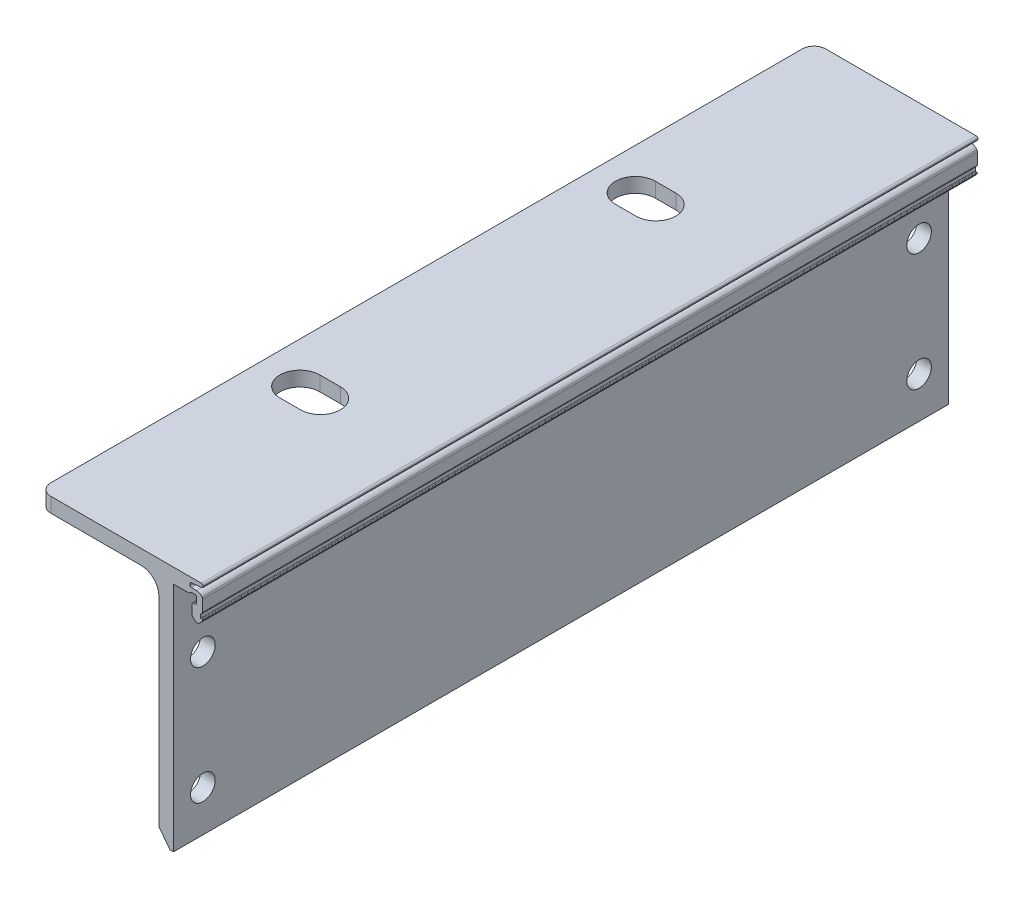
ISO-10303-21;
HEADER;
FILE_DESCRIPTION(('STEP AP214'),'2;1');
FILE_NAME('part.step','',(''),(''),'','','');
FILE_SCHEMA(('AUTOMOTIVE_DESIGN { 1 0 10303 214 1 1 1 1 }'));
ENDSEC;
DATA;
#1=APPLICATION_CONTEXT('core data for automotive mechanical design processes');
#2=APPLICATION_PROTOCOL_DEFINITION('international standard','automotive_design',2000,#1);
#3=PRODUCT_CONTEXT('',#1,'mechanical');
#4=PRODUCT('Part','Part','',(#3));
#5=PRODUCT_RELATED_PRODUCT_CATEGORY('part','',(#4));
#6=PRODUCT_DEFINITION_FORMATION('','',#4);
#7=PRODUCT_DEFINITION_CONTEXT('part definition',#1,'design');
#8=PRODUCT_DEFINITION('design','',#6,#7);
#9=PRODUCT_DEFINITION_SHAPE('','',#8);
#10=(LENGTH_UNIT() NAMED_UNIT(*) SI_UNIT(.MILLI.,.METRE.));
#11=(NAMED_UNIT(*) PLANE_ANGLE_UNIT() SI_UNIT($,.RADIAN.));
#12=(NAMED_UNIT(*) SI_UNIT($,.STERADIAN.) SOLID_ANGLE_UNIT());
#13=UNCERTAINTY_MEASURE_WITH_UNIT(LENGTH_MEASURE(1.E-05),#10,'distance_accuracy_value','');
#14=(GEOMETRIC_REPRESENTATION_CONTEXT(3) GLOBAL_UNCERTAINTY_ASSIGNED_CONTEXT((#13)) GLOBAL_UNIT_ASSIGNED_CONTEXT((#10,
#11,#12)) REPRESENTATION_CONTEXT('',''));
#15=CARTESIAN_POINT('',(0.,0.,0.));
#16=DIRECTION('',(0.,0.,1.));
#17=DIRECTION('',(1.,0.,0.));
#18=AXIS2_PLACEMENT_3D('',#15,#16,#17);
#19=CARTESIAN_POINT('',(2329.98403514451,-3290.10376988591,66.));
#20=DIRECTION('',(0.,-1.,0.));
#21=DIRECTION('',(1.,0.,0.));
#22=AXIS2_PLACEMENT_3D('',#19,#20,#21);
#23=PLANE('',#22);
#24=DIRECTION('',(-1.,0.,0.));
#25=VECTOR('',#24,1.);
#26=CARTESIAN_POINT('',(2340.4840351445,-3290.10376988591,25.1750000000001));
#27=LINE('',#26,#25);
#28=CARTESIAN_POINT('',(2340.4840351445,-3290.10376988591,25.1750000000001));
#29=VERTEX_POINT('',#28);
#30=CARTESIAN_POINT('',(2336.9840351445,-3290.10376988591,25.1750000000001));
#31=VERTEX_POINT('',#30);
#32=EDGE_CURVE('E378',#29,#31,#27,.T.);
#33=ORIENTED_EDGE('',*,*,#32,.F.);
#34=CARTESIAN_POINT('',(2340.4840351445,-3290.10376988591,28.575));
#35=DIRECTION('',(0.,1.,0.));
#36=DIRECTION('',(1.,0.,0.));
#37=AXIS2_PLACEMENT_3D('',#34,#35,#36);
#38=CIRCLE('',#37,3.39999999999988);
#39=CARTESIAN_POINT('',(2340.4840351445,-3290.10376988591,31.9749999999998));
#40=VERTEX_POINT('',#39);
#41=EDGE_CURVE('E383',#40,#29,#38,.T.);
#42=ORIENTED_EDGE('',*,*,#41,.F.);
#43=DIRECTION('',(1.,0.,0.));
#44=VECTOR('',#43,1.);
#45=CARTESIAN_POINT('',(2340.4840351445,-3290.10376988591,31.9749999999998));
#46=LINE('',#45,#44);
#47=CARTESIAN_POINT('',(2336.9840351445,-3290.10376988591,31.9749999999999));
#48=VERTEX_POINT('',#47);
#49=EDGE_CURVE('E387',#48,#40,#46,.T.);
#50=ORIENTED_EDGE('',*,*,#49,.F.);
#51=CARTESIAN_POINT('',(2336.9840351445,-3290.10376988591,28.575));
#52=DIRECTION('',(0.,1.,0.));
#53=DIRECTION('',(1.,0.,0.));
#54=AXIS2_PLACEMENT_3D('',#51,#52,#53);
#55=CIRCLE('',#54,3.39999999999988);
#56=EDGE_CURVE('E367',#31,#48,#55,.T.);
#57=ORIENTED_EDGE('',*,*,#56,.F.);
#58=EDGE_LOOP('',(#33,#42,#50,#57));
#59=FACE_BOUND('',#58,.T.);
#60=DIRECTION('',(1.,0.,0.));
#61=VECTOR('',#60,1.);
#62=CARTESIAN_POINT('',(2340.4840351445,-3290.10376988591,-25.1750000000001));
#63=LINE('',#62,#61);
#64=CARTESIAN_POINT('',(2336.9840351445,-3290.10376988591,-25.1750000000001));
#65=VERTEX_POINT('',#64);
#66=CARTESIAN_POINT('',(2340.4840351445,-3290.10376988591,-25.1750000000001));
#67=VERTEX_POINT('',#66);
#68=EDGE_CURVE('E398',#65,#67,#63,.T.);
#69=ORIENTED_EDGE('',*,*,#68,.F.);
#70=CARTESIAN_POINT('',(2336.9840351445,-3290.10376988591,-28.5749999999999));
#71=DIRECTION('',(0.,1.,0.));
#72=DIRECTION('',(-1.,0.,0.));
#73=AXIS2_PLACEMENT_3D('',#70,#71,#72);
#74=CIRCLE('',#73,3.39999999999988);
#75=CARTESIAN_POINT('',(2336.9840351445,-3290.10376988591,-31.9749999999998));
#76=VERTEX_POINT('',#75);
#77=EDGE_CURVE('E394',#76,#65,#74,.T.);
#78=ORIENTED_EDGE('',*,*,#77,.F.);
#79=DIRECTION('',(-1.,0.,0.));
#80=VECTOR('',#79,1.);
#81=CARTESIAN_POINT('',(2340.4840351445,-3290.10376988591,-31.9749999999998));
#82=LINE('',#81,#80);
#83=CARTESIAN_POINT('',(2340.4840351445,-3290.10376988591,-31.9749999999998));
#84=VERTEX_POINT('',#83);
#85=EDGE_CURVE('E404',#84,#76,#82,.T.);
#86=ORIENTED_EDGE('',*,*,#85,.F.);
#87=CARTESIAN_POINT('',(2340.4840351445,-3290.10376988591,-28.5749999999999));
#88=DIRECTION('',(0.,1.,0.));
#89=DIRECTION('',(-1.,0.,0.));
#90=AXIS2_PLACEMENT_3D('',#87,#88,#89);
#91=CIRCLE('',#90,3.39999999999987);
#92=EDGE_CURVE('E401',#67,#84,#91,.T.);
#93=ORIENTED_EDGE('',*,*,#92,.F.);
#94=EDGE_LOOP('',(#69,#78,#86,#93));
#95=FACE_BOUND('',#94,.T.);
#96=DIRECTION('',(-1.,0.,0.));
#97=VECTOR('',#96,1.);
#98=CARTESIAN_POINT('',(2329.98403514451,-3290.10376988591,-66.));
#99=LINE('',#98,#97);
#100=CARTESIAN_POINT('',(2357.62403514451,-3290.10376988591,-66.));
#101=VERTEX_POINT('',#100);
#102=CARTESIAN_POINT('',(2331.98403514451,-3290.10376988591,-66.));
#103=VERTEX_POINT('',#102);
#104=EDGE_CURVE('E410',#101,#103,#99,.T.);
#105=ORIENTED_EDGE('',*,*,#104,.T.);
#106=CARTESIAN_POINT('',(2331.98403514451,-3290.10376988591,-64.));
#107=DIRECTION('',(0.,-1.,0.));
#108=DIRECTION('',(1.,0.,0.));
#109=AXIS2_PLACEMENT_3D('',#106,#107,#108);
#110=CIRCLE('',#109,2.);
#111=CARTESIAN_POINT('',(2329.98403514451,-3290.10376988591,-64.));
#112=VERTEX_POINT('',#111);
#113=EDGE_CURVE('E44',#103,#112,#110,.F.);
#114=ORIENTED_EDGE('',*,*,#113,.T.);
#115=DIRECTION('',(0.,0.,-1.));
#116=VECTOR('',#115,1.);
#117=CARTESIAN_POINT('',(2329.98403514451,-3290.10376988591,66.));
#118=LINE('',#117,#116);
#119=CARTESIAN_POINT('',(2329.98403514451,-3290.10376988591,64.));
#120=VERTEX_POINT('',#119);
#121=EDGE_CURVE('E688',#120,#112,#118,.T.);
#122=ORIENTED_EDGE('',*,*,#121,.F.);
#123=CARTESIAN_POINT('',(2331.98403514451,-3290.10376988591,64.));
#124=DIRECTION('',(0.,-1.,0.));
#125=DIRECTION('',(1.,0.,0.));
#126=AXIS2_PLACEMENT_3D('',#123,#124,#125);
#127=CIRCLE('',#126,2.);
#128=CARTESIAN_POINT('',(2331.98403514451,-3290.10376988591,66.));
#129=VERTEX_POINT('',#128);
#130=EDGE_CURVE('E51',#120,#129,#127,.F.);
#131=ORIENTED_EDGE('',*,*,#130,.T.);
#132=DIRECTION('',(-1.,0.,0.));
#133=VECTOR('',#132,1.);
#134=CARTESIAN_POINT('',(2355.38403514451,-3290.10376988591,66.));
#135=LINE('',#134,#133);
#136=CARTESIAN_POINT('',(2357.62403514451,-3290.10376988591,66.));
#137=VERTEX_POINT('',#136);
#138=EDGE_CURVE('E417',#137,#129,#135,.T.);
#139=ORIENTED_EDGE('',*,*,#138,.F.);
#140=DIRECTION('',(0.,0.,-1.));
#141=VECTOR('',#140,1.);
#142=CARTESIAN_POINT('',(2357.62403514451,-3290.10376988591,66.));
#143=LINE('',#142,#141);
#144=EDGE_CURVE('E496',#137,#101,#143,.T.);
#145=ORIENTED_EDGE('',*,*,#144,.T.);
#146=EDGE_LOOP('',(#105,#114,#122,#131,#139,#145));
#147=FACE_BOUND('',#146,.T.);
#148=ADVANCED_FACE('F36',(#59,#95,#147),#23,.F.);
#149=CARTESIAN_POINT('',(2329.98403514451,-3290.10376988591,66.));
#150=DIRECTION('',(1.,0.,0.));
#151=DIRECTION('',(0.,0.,-1.));
#152=AXIS2_PLACEMENT_3D('',#149,#150,#151);
#153=PLANE('',#152);
#154=ORIENTED_EDGE('',*,*,#121,.T.);
#155=DIRECTION('',(0.,-1.,0.));
#156=VECTOR('',#155,1.);
#157=CARTESIAN_POINT('',(2329.98403514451,-3292.60376988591,-64.));
#158=LINE('',#157,#156);
#159=CARTESIAN_POINT('',(2329.98403514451,-3292.60376988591,-64.));
#160=VERTEX_POINT('',#159);
#161=EDGE_CURVE('E741',#112,#160,#158,.T.);
#162=ORIENTED_EDGE('',*,*,#161,.T.);
#163=DIRECTION('',(0.,0.,-1.));
#164=VECTOR('',#163,1.);
#165=CARTESIAN_POINT('',(2329.98403514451,-3292.60376988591,66.));
#166=LINE('',#165,#164);
#167=CARTESIAN_POINT('',(2329.98403514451,-3292.60376988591,64.));
#168=VERTEX_POINT('',#167);
#169=EDGE_CURVE('E685',#168,#160,#166,.T.);
#170=ORIENTED_EDGE('',*,*,#169,.F.);
#171=DIRECTION('',(0.,-1.,0.));
#172=VECTOR('',#171,1.);
#173=CARTESIAN_POINT('',(2329.98403514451,-3290.10376988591,64.));
#174=LINE('',#173,#172);
#175=EDGE_CURVE('E723',#168,#120,#174,.F.);
#176=ORIENTED_EDGE('',*,*,#175,.T.);
#177=EDGE_LOOP('',(#154,#162,#170,#176));
#178=FACE_BOUND('',#177,.T.);
#179=ADVANCED_FACE('F753',(#178),#153,.F.);
#180=CARTESIAN_POINT('',(2329.98403514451,-3292.60376988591,66.));
#181=DIRECTION('',(0.,1.,0.));
#182=DIRECTION('',(0.,0.,1.));
#183=AXIS2_PLACEMENT_3D('',#180,#181,#182);
#184=PLANE('',#183);
#185=DIRECTION('',(1.,0.,0.));
#186=VECTOR('',#185,1.);
#187=CARTESIAN_POINT('',(2329.98403514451,-3292.60376988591,31.9749999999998));
#188=LINE('',#187,#186);
#189=CARTESIAN_POINT('',(2336.9840351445,-3292.60376988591,31.9749999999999));
#190=VERTEX_POINT('',#189);
#191=CARTESIAN_POINT('',(2340.4840351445,-3292.60376988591,31.9749999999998));
#192=VERTEX_POINT('',#191);
#193=EDGE_CURVE('E717',#190,#192,#188,.T.);
#194=ORIENTED_EDGE('',*,*,#193,.T.);
#195=CARTESIAN_POINT('',(2340.4840351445,-3292.60376988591,28.575));
#196=DIRECTION('',(0.,1.,0.));
#197=DIRECTION('',(0.,0.,1.));
#198=AXIS2_PLACEMENT_3D('',#195,#196,#197);
#199=CIRCLE('',#198,3.39999999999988);
#200=CARTESIAN_POINT('',(2340.4840351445,-3292.60376988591,25.1750000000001));
#201=VERTEX_POINT('',#200);
#202=EDGE_CURVE('E720',#192,#201,#199,.T.);
#203=ORIENTED_EDGE('',*,*,#202,.T.);
#204=DIRECTION('',(-1.,0.,0.));
#205=VECTOR('',#204,1.);
#206=CARTESIAN_POINT('',(2329.98403514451,-3292.60376988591,25.1750000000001));
#207=LINE('',#206,#205);
#208=CARTESIAN_POINT('',(2336.9840351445,-3292.60376988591,25.1750000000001));
#209=VERTEX_POINT('',#208);
#210=EDGE_CURVE('E714',#201,#209,#207,.T.);
#211=ORIENTED_EDGE('',*,*,#210,.T.);
#212=CARTESIAN_POINT('',(2336.9840351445,-3292.60376988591,28.575));
#213=DIRECTION('',(0.,1.,0.));
#214=DIRECTION('',(0.,0.,1.));
#215=AXIS2_PLACEMENT_3D('',#212,#213,#214);
#216=CIRCLE('',#215,3.39999999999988);
#217=EDGE_CURVE('E370',#209,#190,#216,.T.);
#218=ORIENTED_EDGE('',*,*,#217,.T.);
#219=EDGE_LOOP('',(#194,#203,#211,#218));
#220=FACE_BOUND('',#219,.T.);
#221=DIRECTION('',(-1.,0.,0.));
#222=VECTOR('',#221,1.);
#223=CARTESIAN_POINT('',(2329.98403514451,-3292.60376988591,-31.9749999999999));
#224=LINE('',#223,#222);
#225=CARTESIAN_POINT('',(2340.4840351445,-3292.60376988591,-31.9749999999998));
#226=VERTEX_POINT('',#225);
#227=CARTESIAN_POINT('',(2336.9840351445,-3292.60376988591,-31.9749999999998));
#228=VERTEX_POINT('',#227);
#229=EDGE_CURVE('E708',#226,#228,#224,.T.);
#230=ORIENTED_EDGE('',*,*,#229,.T.);
#231=CARTESIAN_POINT('',(2336.9840351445,-3292.60376988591,-28.5749999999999));
#232=DIRECTION('',(0.,1.,0.));
#233=DIRECTION('',(0.,0.,1.));
#234=AXIS2_PLACEMENT_3D('',#231,#232,#233);
#235=CIRCLE('',#234,3.39999999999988);
#236=CARTESIAN_POINT('',(2336.9840351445,-3292.60376988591,-25.1750000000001));
#237=VERTEX_POINT('',#236);
#238=EDGE_CURVE('E711',#228,#237,#235,.T.);
#239=ORIENTED_EDGE('',*,*,#238,.T.);
#240=DIRECTION('',(1.,0.,0.));
#241=VECTOR('',#240,1.);
#242=CARTESIAN_POINT('',(2329.98403514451,-3292.60376988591,-25.1750000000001));
#243=LINE('',#242,#241);
#244=CARTESIAN_POINT('',(2340.4840351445,-3292.60376988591,-25.1750000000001));
#245=VERTEX_POINT('',#244);
#246=EDGE_CURVE('E702',#237,#245,#243,.T.);
#247=ORIENTED_EDGE('',*,*,#246,.T.);
#248=CARTESIAN_POINT('',(2340.4840351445,-3292.60376988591,-28.5749999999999));
#249=DIRECTION('',(0.,1.,0.));
#250=DIRECTION('',(0.,0.,1.));
#251=AXIS2_PLACEMENT_3D('',#248,#249,#250);
#252=CIRCLE('',#251,3.39999999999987);
#253=EDGE_CURVE('E705',#245,#226,#252,.T.);
#254=ORIENTED_EDGE('',*,*,#253,.T.);
#255=EDGE_LOOP('',(#230,#239,#247,#254));
#256=FACE_BOUND('',#255,.T.);
#257=ORIENTED_EDGE('',*,*,#169,.T.);
#258=CARTESIAN_POINT('',(2331.98403514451,-3292.60376988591,-64.));
#259=DIRECTION('',(0.,1.,0.));
#260=DIRECTION('',(0.,0.,1.));
#261=AXIS2_PLACEMENT_3D('',#258,#259,#260);
#262=CIRCLE('',#261,2.);
#263=CARTESIAN_POINT('',(2331.98403514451,-3292.60376988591,-66.));
#264=VERTEX_POINT('',#263);
#265=EDGE_CURVE('E746',#160,#264,#262,.F.);
#266=ORIENTED_EDGE('',*,*,#265,.T.);
#267=DIRECTION('',(1.,0.,0.));
#268=VECTOR('',#267,1.);
#269=CARTESIAN_POINT('',(2329.98403514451,-3292.60376988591,-66.));
#270=LINE('',#269,#268);
#271=CARTESIAN_POINT('',(2347.3840351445,-3292.60376988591,-66.));
#272=VERTEX_POINT('',#271);
#273=EDGE_CURVE('E498',#264,#272,#270,.T.);
#274=ORIENTED_EDGE('',*,*,#273,.T.);
#275=DIRECTION('',(0.,0.,-1.));
#276=VECTOR('',#275,1.);
#277=CARTESIAN_POINT('',(2347.3840351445,-3292.60376988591,66.));
#278=LINE('',#277,#276);
#279=CARTESIAN_POINT('',(2347.3840351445,-3292.60376988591,66.));
#280=VERTEX_POINT('',#279);
#281=EDGE_CURVE('E694',#272,#280,#278,.F.);
#282=ORIENTED_EDGE('',*,*,#281,.T.);
#283=DIRECTION('',(1.,0.,0.));
#284=VECTOR('',#283,1.);
#285=CARTESIAN_POINT('',(2329.98403514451,-3292.60376988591,66.));
#286=LINE('',#285,#284);
#287=CARTESIAN_POINT('',(2331.98403514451,-3292.60376988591,66.));
#288=VERTEX_POINT('',#287);
#289=EDGE_CURVE('E419',#288,#280,#286,.T.);
#290=ORIENTED_EDGE('',*,*,#289,.F.);
#291=CARTESIAN_POINT('',(2331.98403514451,-3292.60376988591,64.));
#292=DIRECTION('',(0.,1.,0.));
#293=DIRECTION('',(0.,0.,1.));
#294=AXIS2_PLACEMENT_3D('',#291,#292,#293);
#295=CIRCLE('',#294,2.);
#296=EDGE_CURVE('E744',#288,#168,#295,.F.);
#297=ORIENTED_EDGE('',*,*,#296,.T.);
#298=EDGE_LOOP('',(#257,#266,#274,#282,#290,#297));
#299=FACE_BOUND('',#298,.T.);
#300=ADVANCED_FACE('F758',(#220,#256,#299),#184,.F.);
#301=CARTESIAN_POINT('',(2350.3840351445,-3292.60376988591,66.));
#302=DIRECTION('',(1.,0.,0.));
#303=DIRECTION('',(0.,0.,-1.));
#304=AXIS2_PLACEMENT_3D('',#301,#302,#303);
#305=PLANE('',#304);
#306=CARTESIAN_POINT('',(2350.38403514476,-3325.10376988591,61.0000000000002));
#307=DIRECTION('',(-1.,0.,0.));
#308=DIRECTION('',(0.,1.,0.));
#309=AXIS2_PLACEMENT_3D('',#306,#307,#308);
#310=CIRCLE('',#309,2.09999999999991);
#311=CARTESIAN_POINT('',(2350.38403514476,-3323.00376988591,61.0000000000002));
#312=VERTEX_POINT('',#311);
#313=EDGE_CURVE('E739',#312,#312,#310,.T.);
#314=ORIENTED_EDGE('',*,*,#313,.F.);
#315=EDGE_LOOP('',(#314));
#316=FACE_BOUND('',#315,.T.);
#317=CARTESIAN_POINT('',(2350.38403514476,-3325.10376988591,-60.9999999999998));
#318=DIRECTION('',(-1.,0.,0.));
#319=DIRECTION('',(0.,-1.,0.));
#320=AXIS2_PLACEMENT_3D('',#317,#318,#319);
#321=CIRCLE('',#320,2.09999999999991);
#322=CARTESIAN_POINT('',(2350.38403514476,-3327.20376988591,-60.9999999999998));
#323=VERTEX_POINT('',#322);
#324=EDGE_CURVE('E735',#323,#323,#321,.T.);
#325=ORIENTED_EDGE('',*,*,#324,.F.);
#326=EDGE_LOOP('',(#325));
#327=FACE_BOUND('',#326,.T.);
#328=CARTESIAN_POINT('',(2350.38403514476,-3305.10376988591,61.));
#329=DIRECTION('',(-1.,0.,0.));
#330=DIRECTION('',(0.,1.,0.));
#331=AXIS2_PLACEMENT_3D('',#328,#329,#330);
#332=CIRCLE('',#331,2.09999999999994);
#333=CARTESIAN_POINT('',(2350.38403514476,-3303.00376988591,61.));
#334=VERTEX_POINT('',#333);
#335=EDGE_CURVE('E731',#334,#334,#332,.T.);
#336=ORIENTED_EDGE('',*,*,#335,.F.);
#337=EDGE_LOOP('',(#336));
#338=FACE_BOUND('',#337,.T.);
#339=CARTESIAN_POINT('',(2350.38403514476,-3305.10376988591,-61.));
#340=DIRECTION('',(-1.,0.,0.));
#341=DIRECTION('',(0.,-1.,0.));
#342=AXIS2_PLACEMENT_3D('',#339,#340,#341);
#343=CIRCLE('',#342,2.09999999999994);
#344=CARTESIAN_POINT('',(2350.38403514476,-3307.20376988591,-61.));
#345=VERTEX_POINT('',#344);
#346=EDGE_CURVE('E727',#345,#345,#343,.T.);
#347=ORIENTED_EDGE('',*,*,#346,.F.);
#348=EDGE_LOOP('',(#347));
#349=FACE_BOUND('',#348,.T.);
#350=DIRECTION('',(0.,-1.,0.));
#351=VECTOR('',#350,1.);
#352=CARTESIAN_POINT('',(2350.3840351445,-3292.60376988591,66.));
#353=LINE('',#352,#351);
#354=CARTESIAN_POINT('',(2350.3840351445,-3295.60376988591,66.));
#355=VERTEX_POINT('',#354);
#356=CARTESIAN_POINT('',(2350.3840351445,-3329.60376988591,66.));
#357=VERTEX_POINT('',#356);
#358=EDGE_CURVE('E422',#355,#357,#353,.T.);
#359=ORIENTED_EDGE('',*,*,#358,.F.);
#360=DIRECTION('',(0.,0.,-1.));
#361=VECTOR('',#360,1.);
#362=CARTESIAN_POINT('',(2350.3840351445,-3295.60376988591,-66.));
#363=LINE('',#362,#361);
#364=CARTESIAN_POINT('',(2350.3840351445,-3295.60376988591,-66.));
#365=VERTEX_POINT('',#364);
#366=EDGE_CURVE('E691',#355,#365,#363,.T.);
#367=ORIENTED_EDGE('',*,*,#366,.T.);
#368=DIRECTION('',(0.,-1.,0.));
#369=VECTOR('',#368,1.);
#370=CARTESIAN_POINT('',(2350.3840351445,-3292.60376988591,-66.));
#371=LINE('',#370,#369);
#372=CARTESIAN_POINT('',(2350.3840351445,-3329.60376988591,-66.));
#373=VERTEX_POINT('',#372);
#374=EDGE_CURVE('E500',#365,#373,#371,.T.);
#375=ORIENTED_EDGE('',*,*,#374,.T.);
#376=DIRECTION('',(0.,0.,-1.));
#377=VECTOR('',#376,1.);
#378=CARTESIAN_POINT('',(2350.3840351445,-3329.60376988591,66.));
#379=LINE('',#378,#377);
#380=EDGE_CURVE('E682',#357,#373,#379,.T.);
#381=ORIENTED_EDGE('',*,*,#380,.F.);
#382=EDGE_LOOP('',(#359,#367,#375,#381));
#383=FACE_BOUND('',#382,.T.);
#384=ADVANCED_FACE('F944',(#316,#327,#338,#349,#383),#305,.F.);
#385=CARTESIAN_POINT('',(2350.3840351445,-3329.60376988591,66.));
#386=DIRECTION('',(0.796162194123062,0.605083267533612,0.));
#387=DIRECTION('',(-0.605083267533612,0.796162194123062,0.));
#388=AXIS2_PLACEMENT_3D('',#385,#386,#387);
#389=PLANE('',#388);
#390=DIRECTION('',(0.605083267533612,-0.796162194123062,0.));
#391=VECTOR('',#390,1.);
#392=CARTESIAN_POINT('',(2350.3840351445,-3329.60376988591,-66.));
#393=LINE('',#392,#391);
#394=CARTESIAN_POINT('',(2352.28403514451,-3332.10376988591,-66.));
#395=VERTEX_POINT('',#394);
#396=EDGE_CURVE('E502',#373,#395,#393,.T.);
#397=ORIENTED_EDGE('',*,*,#396,.T.);
#398=DIRECTION('',(0.,0.,-1.));
#399=VECTOR('',#398,1.);
#400=CARTESIAN_POINT('',(2352.28403514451,-3332.10376988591,66.));
#401=LINE('',#400,#399);
#402=CARTESIAN_POINT('',(2352.28403514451,-3332.10376988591,66.));
#403=VERTEX_POINT('',#402);
#404=EDGE_CURVE('E679',#403,#395,#401,.T.);
#405=ORIENTED_EDGE('',*,*,#404,.F.);
#406=DIRECTION('',(0.605083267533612,-0.796162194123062,0.));
#407=VECTOR('',#406,1.);
#408=CARTESIAN_POINT('',(2350.3840351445,-3329.60376988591,66.));
#409=LINE('',#408,#407);
#410=EDGE_CURVE('E424',#357,#403,#409,.T.);
#411=ORIENTED_EDGE('',*,*,#410,.F.);
#412=ORIENTED_EDGE('',*,*,#380,.T.);
#413=EDGE_LOOP('',(#397,#405,#411,#412));
#414=FACE_BOUND('',#413,.T.);
#415=ADVANCED_FACE('F940',(#414),#389,.F.);
#416=CARTESIAN_POINT('',(2352.88403514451,-3332.10376988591,66.));
#417=DIRECTION('',(0.,1.,0.));
#418=DIRECTION('',(0.,0.,1.));
#419=AXIS2_PLACEMENT_3D('',#416,#417,#418);
#420=PLANE('',#419);
#421=DIRECTION('',(1.,0.,0.));
#422=VECTOR('',#421,1.);
#423=CARTESIAN_POINT('',(2352.88403514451,-3332.10376988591,-66.));
#424=LINE('',#423,#422);
#425=CARTESIAN_POINT('',(2352.88403514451,-3332.10376988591,-66.));
#426=VERTEX_POINT('',#425);
#427=EDGE_CURVE('E504',#395,#426,#424,.T.);
#428=ORIENTED_EDGE('',*,*,#427,.T.);
#429=DIRECTION('',(0.,0.,-1.));
#430=VECTOR('',#429,1.);
#431=CARTESIAN_POINT('',(2352.88403514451,-3332.10376988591,66.));
#432=LINE('',#431,#430);
#433=CARTESIAN_POINT('',(2352.88403514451,-3332.10376988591,66.));
#434=VERTEX_POINT('',#433);
#435=EDGE_CURVE('E676',#434,#426,#432,.T.);
#436=ORIENTED_EDGE('',*,*,#435,.F.);
#437=DIRECTION('',(1.,0.,0.));
#438=VECTOR('',#437,1.);
#439=CARTESIAN_POINT('',(2352.88403514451,-3332.10376988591,66.));
#440=LINE('',#439,#438);
#441=EDGE_CURVE('E426',#403,#434,#440,.T.);
#442=ORIENTED_EDGE('',*,*,#441,.F.);
#443=ORIENTED_EDGE('',*,*,#404,.T.);
#444=EDGE_LOOP('',(#428,#436,#442,#443));
#445=FACE_BOUND('',#444,.T.);
#446=ADVANCED_FACE('F936',(#445),#420,.F.);
#447=CARTESIAN_POINT('',(2352.88403514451,-3292.60376988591,66.));
#448=DIRECTION('',(-1.,0.,0.));
#449=DIRECTION('',(0.,0.,1.));
#450=AXIS2_PLACEMENT_3D('',#447,#448,#449);
#451=PLANE('',#450);
#452=CARTESIAN_POINT('',(2352.88403514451,-3325.10376988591,61.0000000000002));
#453=DIRECTION('',(-1.,0.,0.));
#454=DIRECTION('',(0.,0.,1.));
#455=AXIS2_PLACEMENT_3D('',#452,#453,#454);
#456=CIRCLE('',#455,2.09999999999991);
#457=CARTESIAN_POINT('',(2352.88403514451,-3325.10376988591,63.1000000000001));
#458=VERTEX_POINT('',#457);
#459=EDGE_CURVE('E736',#458,#458,#456,.T.);
#460=ORIENTED_EDGE('',*,*,#459,.T.);
#461=EDGE_LOOP('',(#460));
#462=FACE_BOUND('',#461,.T.);
#463=CARTESIAN_POINT('',(2352.88403514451,-3325.10376988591,-60.9999999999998));
#464=DIRECTION('',(-1.,0.,0.));
#465=DIRECTION('',(0.,0.,1.));
#466=AXIS2_PLACEMENT_3D('',#463,#464,#465);
#467=CIRCLE('',#466,2.09999999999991);
#468=CARTESIAN_POINT('',(2352.88403514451,-3325.10376988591,-58.8999999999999));
#469=VERTEX_POINT('',#468);
#470=EDGE_CURVE('E732',#469,#469,#467,.T.);
#471=ORIENTED_EDGE('',*,*,#470,.T.);
#472=EDGE_LOOP('',(#471));
#473=FACE_BOUND('',#472,.T.);
#474=CARTESIAN_POINT('',(2352.88403514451,-3305.10376988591,61.));
#475=DIRECTION('',(-1.,0.,0.));
#476=DIRECTION('',(0.,0.,1.));
#477=AXIS2_PLACEMENT_3D('',#474,#475,#476);
#478=CIRCLE('',#477,2.09999999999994);
#479=CARTESIAN_POINT('',(2352.88403514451,-3305.10376988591,63.1));
#480=VERTEX_POINT('',#479);
#481=EDGE_CURVE('E728',#480,#480,#478,.T.);
#482=ORIENTED_EDGE('',*,*,#481,.T.);
#483=EDGE_LOOP('',(#482));
#484=FACE_BOUND('',#483,.T.);
#485=CARTESIAN_POINT('',(2352.88403514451,-3305.10376988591,-61.));
#486=DIRECTION('',(-1.,0.,0.));
#487=DIRECTION('',(0.,0.,1.));
#488=AXIS2_PLACEMENT_3D('',#485,#486,#487);
#489=CIRCLE('',#488,2.09999999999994);
#490=CARTESIAN_POINT('',(2352.88403514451,-3305.10376988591,-58.9000000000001));
#491=VERTEX_POINT('',#490);
#492=EDGE_CURVE('E724',#491,#491,#489,.T.);
#493=ORIENTED_EDGE('',*,*,#492,.T.);
#494=EDGE_LOOP('',(#493));
#495=FACE_BOUND('',#494,.T.);
#496=DIRECTION('',(0.,1.,0.));
#497=VECTOR('',#496,1.);
#498=CARTESIAN_POINT('',(2352.88403514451,-3292.60376988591,-66.));
#499=LINE('',#498,#497);
#500=CARTESIAN_POINT('',(2352.88403514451,-3292.60376988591,-66.));
#501=VERTEX_POINT('',#500);
#502=EDGE_CURVE('E506',#426,#501,#499,.T.);
#503=ORIENTED_EDGE('',*,*,#502,.T.);
#504=DIRECTION('',(0.,0.,-1.));
#505=VECTOR('',#504,1.);
#506=CARTESIAN_POINT('',(2352.88403514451,-3292.60376988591,66.));
#507=LINE('',#506,#505);
#508=CARTESIAN_POINT('',(2352.88403514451,-3292.60376988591,66.));
#509=VERTEX_POINT('',#508);
#510=EDGE_CURVE('E673',#509,#501,#507,.T.);
#511=ORIENTED_EDGE('',*,*,#510,.F.);
#512=DIRECTION('',(0.,1.,0.));
#513=VECTOR('',#512,1.);
#514=CARTESIAN_POINT('',(2352.88403514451,-3292.60376988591,66.));
#515=LINE('',#514,#513);
#516=EDGE_CURVE('E428',#434,#509,#515,.T.);
#517=ORIENTED_EDGE('',*,*,#516,.F.);
#518=ORIENTED_EDGE('',*,*,#435,.T.);
#519=EDGE_LOOP('',(#503,#511,#517,#518));
#520=FACE_BOUND('',#519,.T.);
#521=ADVANCED_FACE('F932',(#462,#473,#484,#495,#520),#451,.F.);
#522=CARTESIAN_POINT('',(2355.38403514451,-3292.60376988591,66.));
#523=DIRECTION('',(0.,1.,0.));
#524=DIRECTION('',(0.,0.,1.));
#525=AXIS2_PLACEMENT_3D('',#522,#523,#524);
#526=PLANE('',#525);
#527=DIRECTION('',(1.,0.,0.));
#528=VECTOR('',#527,1.);
#529=CARTESIAN_POINT('',(2355.38403514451,-3292.60376988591,-66.));
#530=LINE('',#529,#528);
#531=CARTESIAN_POINT('',(2355.46834905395,-3292.60376988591,-66.));
#532=VERTEX_POINT('',#531);
#533=EDGE_CURVE('E509',#501,#532,#530,.T.);
#534=ORIENTED_EDGE('',*,*,#533,.T.);
#535=DIRECTION('',(0.,0.,-1.));
#536=VECTOR('',#535,1.);
#537=CARTESIAN_POINT('',(2355.46834905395,-3292.60376988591,66.));
#538=LINE('',#537,#536);
#539=CARTESIAN_POINT('',(2355.46834905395,-3292.60376988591,66.));
#540=VERTEX_POINT('',#539);
#541=EDGE_CURVE('E670',#540,#532,#538,.T.);
#542=ORIENTED_EDGE('',*,*,#541,.F.);
#543=DIRECTION('',(1.,-3.55271367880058E-13,0.));
#544=VECTOR('',#543,1.);
#545=CARTESIAN_POINT('',(2352.88403514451,-3292.60376988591,66.));
#546=LINE('',#545,#544);
#547=EDGE_CURVE('E430',#509,#540,#546,.T.);
#548=ORIENTED_EDGE('',*,*,#547,.F.);
#549=ORIENTED_EDGE('',*,*,#510,.T.);
#550=EDGE_LOOP('',(#534,#542,#548,#549));
#551=FACE_BOUND('',#550,.T.);
#552=ADVANCED_FACE('F928',(#551),#526,.F.);
#553=CARTESIAN_POINT('',(2355.46834905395,-3292.30376988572,66.));
#554=DIRECTION('',(0.,0.,-1.));
#555=DIRECTION('',(-1.,0.,0.));
#556=AXIS2_PLACEMENT_3D('',#553,#554,#555);
#557=CYLINDRICAL_SURFACE('',#556,0.300000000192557);
#558=CARTESIAN_POINT('',(2355.46834905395,-3292.30376988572,-66.));
#559=DIRECTION('',(0.,0.,1.));
#560=DIRECTION('',(-1.,0.,0.));
#561=AXIS2_PLACEMENT_3D('',#558,#559,#560);
#562=CIRCLE('',#561,0.300000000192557);
#563=CARTESIAN_POINT('',(2355.72815667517,-3292.45376988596,-66.));
#564=VERTEX_POINT('',#563);
#565=EDGE_CURVE('E511',#532,#564,#562,.T.);
#566=ORIENTED_EDGE('',*,*,#565,.T.);
#567=DIRECTION('',(0.,0.,-1.));
#568=VECTOR('',#567,1.);
#569=CARTESIAN_POINT('',(2355.72815667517,-3292.45376988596,66.));
#570=LINE('',#569,#568);
#571=CARTESIAN_POINT('',(2355.72815667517,-3292.45376988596,66.));
#572=VERTEX_POINT('',#571);
#573=EDGE_CURVE('E667',#572,#564,#570,.T.);
#574=ORIENTED_EDGE('',*,*,#573,.F.);
#575=CARTESIAN_POINT('',(2355.46834905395,-3292.30376988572,66.));
#576=DIRECTION('',(0.,0.,1.));
#577=DIRECTION('',(-1.,0.,0.));
#578=AXIS2_PLACEMENT_3D('',#575,#576,#577);
#579=CIRCLE('',#578,0.300000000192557);
#580=EDGE_CURVE('E432',#540,#572,#579,.T.);
#581=ORIENTED_EDGE('',*,*,#580,.F.);
#582=ORIENTED_EDGE('',*,*,#541,.T.);
#583=EDGE_LOOP('',(#566,#574,#581,#582));
#584=FACE_BOUND('',#583,.T.);
#585=ADVANCED_FACE('F924',(#584),#557,.T.);
#586=CARTESIAN_POINT('',(2355.9879642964,-3292.60376988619,66.));
#587=DIRECTION('',(0.,0.,-1.));
#588=DIRECTION('',(-1.,0.,0.));
#589=AXIS2_PLACEMENT_3D('',#586,#587,#588);
#590=CYLINDRICAL_SURFACE('',#589,0.300000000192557);
#591=CARTESIAN_POINT('',(2355.9879642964,-3292.60376988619,-66.));
#592=DIRECTION('',(0.,0.,-1.));
#593=DIRECTION('',(-1.,0.,0.));
#594=AXIS2_PLACEMENT_3D('',#591,#592,#593);
#595=CIRCLE('',#594,0.300000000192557);
#596=CARTESIAN_POINT('',(2355.9879642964,-3292.303769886,-66.));
#597=VERTEX_POINT('',#596);
#598=EDGE_CURVE('E513',#564,#597,#595,.T.);
#599=ORIENTED_EDGE('',*,*,#598,.T.);
#600=DIRECTION('',(0.,0.,-1.));
#601=VECTOR('',#600,1.);
#602=CARTESIAN_POINT('',(2355.9879642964,-3292.303769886,66.));
#603=LINE('',#602,#601);
#604=CARTESIAN_POINT('',(2355.9879642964,-3292.303769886,66.));
#605=VERTEX_POINT('',#604);
#606=EDGE_CURVE('E664',#605,#597,#603,.T.);
#607=ORIENTED_EDGE('',*,*,#606,.F.);
#608=CARTESIAN_POINT('',(2355.9879642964,-3292.60376988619,66.));
#609=DIRECTION('',(0.,0.,-1.));
#610=DIRECTION('',(-1.,0.,0.));
#611=AXIS2_PLACEMENT_3D('',#608,#609,#610);
#612=CIRCLE('',#611,0.300000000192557);
#613=EDGE_CURVE('E434',#572,#605,#612,.T.);
#614=ORIENTED_EDGE('',*,*,#613,.F.);
#615=ORIENTED_EDGE('',*,*,#573,.T.);
#616=EDGE_LOOP('',(#599,#607,#614,#615));
#617=FACE_BOUND('',#616,.T.);
#618=ADVANCED_FACE('F920',(#617),#590,.F.);
#619=CARTESIAN_POINT('',(2356.52403514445,-3292.303769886,66.));
#620=DIRECTION('',(0.,1.,0.));
#621=DIRECTION('',(0.,0.,1.));
#622=AXIS2_PLACEMENT_3D('',#619,#620,#621);
#623=PLANE('',#622);
#624=DIRECTION('',(1.,0.,0.));
#625=VECTOR('',#624,1.);
#626=CARTESIAN_POINT('',(2356.52403514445,-3292.303769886,-66.));
#627=LINE('',#626,#625);
#628=CARTESIAN_POINT('',(2356.52403514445,-3292.303769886,-66.));
#629=VERTEX_POINT('',#628);
#630=EDGE_CURVE('E515',#597,#629,#627,.T.);
#631=ORIENTED_EDGE('',*,*,#630,.T.);
#632=DIRECTION('',(0.,0.,-1.));
#633=VECTOR('',#632,1.);
#634=CARTESIAN_POINT('',(2356.52403514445,-3292.303769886,66.));
#635=LINE('',#634,#633);
#636=CARTESIAN_POINT('',(2356.52403514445,-3292.303769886,66.));
#637=VERTEX_POINT('',#636);
#638=EDGE_CURVE('E661',#637,#629,#635,.T.);
#639=ORIENTED_EDGE('',*,*,#638,.F.);
#640=DIRECTION('',(1.,0.,0.));
#641=VECTOR('',#640,1.);
#642=CARTESIAN_POINT('',(2356.52403514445,-3292.303769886,66.));
#643=LINE('',#642,#641);
#644=EDGE_CURVE('E436',#605,#637,#643,.T.);
#645=ORIENTED_EDGE('',*,*,#644,.F.);
#646=ORIENTED_EDGE('',*,*,#606,.T.);
#647=EDGE_LOOP('',(#631,#639,#645,#646));
#648=FACE_BOUND('',#647,.T.);
#649=ADVANCED_FACE('F916',(#648),#623,.F.);
#650=CARTESIAN_POINT('',(2356.52403514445,-3292.603769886,66.));
#651=DIRECTION('',(0.,0.,-1.));
#652=DIRECTION('',(-1.,0.,0.));
#653=AXIS2_PLACEMENT_3D('',#650,#651,#652);
#654=CYLINDRICAL_SURFACE('',#653,0.300000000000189);
#655=CARTESIAN_POINT('',(2356.52403514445,-3292.603769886,-66.));
#656=DIRECTION('',(0.,0.,-1.));
#657=DIRECTION('',(-1.,0.,0.));
#658=AXIS2_PLACEMENT_3D('',#655,#656,#657);
#659=CIRCLE('',#658,0.300000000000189);
#660=CARTESIAN_POINT('',(2356.82403514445,-3292.603769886,-66.));
#661=VERTEX_POINT('',#660);
#662=EDGE_CURVE('E517',#629,#661,#659,.T.);
#663=ORIENTED_EDGE('',*,*,#662,.T.);
#664=DIRECTION('',(0.,0.,-1.));
#665=VECTOR('',#664,1.);
#666=CARTESIAN_POINT('',(2356.82403514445,-3292.603769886,66.));
#667=LINE('',#666,#665);
#668=CARTESIAN_POINT('',(2356.82403514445,-3292.603769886,66.));
#669=VERTEX_POINT('',#668);
#670=EDGE_CURVE('E658',#669,#661,#667,.T.);
#671=ORIENTED_EDGE('',*,*,#670,.F.);
#672=CARTESIAN_POINT('',(2356.52403514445,-3292.603769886,66.));
#673=DIRECTION('',(0.,0.,-1.));
#674=DIRECTION('',(-1.,0.,0.));
#675=AXIS2_PLACEMENT_3D('',#672,#673,#674);
#676=CIRCLE('',#675,0.300000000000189);
#677=EDGE_CURVE('E438',#637,#669,#676,.T.);
#678=ORIENTED_EDGE('',*,*,#677,.F.);
#679=ORIENTED_EDGE('',*,*,#638,.T.);
#680=EDGE_LOOP('',(#663,#671,#678,#679));
#681=FACE_BOUND('',#680,.T.);
#682=ADVANCED_FACE('F912',(#681),#654,.F.);
#683=CARTESIAN_POINT('',(2356.82403514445,-3293.40376988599,66.));
#684=DIRECTION('',(1.,0.,0.));
#685=DIRECTION('',(0.,0.,-1.));
#686=AXIS2_PLACEMENT_3D('',#683,#684,#685);
#687=PLANE('',#686);
#688=DIRECTION('',(0.,-1.,0.));
#689=VECTOR('',#688,1.);
#690=CARTESIAN_POINT('',(2356.82403514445,-3293.40376988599,-66.));
#691=LINE('',#690,#689);
#692=CARTESIAN_POINT('',(2356.82403514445,-3293.40376988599,-66.));
#693=VERTEX_POINT('',#692);
#694=EDGE_CURVE('E519',#661,#693,#691,.T.);
#695=ORIENTED_EDGE('',*,*,#694,.T.);
#696=DIRECTION('',(0.,0.,-1.));
#697=VECTOR('',#696,1.);
#698=CARTESIAN_POINT('',(2356.82403514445,-3293.40376988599,66.));
#699=LINE('',#698,#697);
#700=CARTESIAN_POINT('',(2356.82403514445,-3293.40376988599,66.));
#701=VERTEX_POINT('',#700);
#702=EDGE_CURVE('E655',#701,#693,#699,.T.);
#703=ORIENTED_EDGE('',*,*,#702,.F.);
#704=DIRECTION('',(0.,-1.,0.));
#705=VECTOR('',#704,1.);
#706=CARTESIAN_POINT('',(2356.82403514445,-3293.40376988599,66.));
#707=LINE('',#706,#705);
#708=EDGE_CURVE('E440',#669,#701,#707,.T.);
#709=ORIENTED_EDGE('',*,*,#708,.F.);
#710=ORIENTED_EDGE('',*,*,#670,.T.);
#711=EDGE_LOOP('',(#695,#703,#709,#710));
#712=FACE_BOUND('',#711,.T.);
#713=ADVANCED_FACE('F908',(#712),#687,.F.);
#714=CARTESIAN_POINT('',(2356.52403514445,-3293.40376988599,66.));
#715=DIRECTION('',(0.,0.,-1.));
#716=DIRECTION('',(-1.,0.,0.));
#717=AXIS2_PLACEMENT_3D('',#714,#715,#716);
#718=CYLINDRICAL_SURFACE('',#717,0.300000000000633);
#719=CARTESIAN_POINT('',(2356.52403514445,-3293.40376988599,-66.));
#720=DIRECTION('',(0.,0.,-1.));
#721=DIRECTION('',(-1.,0.,0.));
#722=AXIS2_PLACEMENT_3D('',#719,#720,#721);
#723=CIRCLE('',#722,0.300000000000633);
#724=CARTESIAN_POINT('',(2356.52403514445,-3293.70376988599,-66.));
#725=VERTEX_POINT('',#724);
#726=EDGE_CURVE('E521',#693,#725,#723,.T.);
#727=ORIENTED_EDGE('',*,*,#726,.T.);
#728=DIRECTION('',(0.,0.,-1.));
#729=VECTOR('',#728,1.);
#730=CARTESIAN_POINT('',(2356.52403514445,-3293.70376988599,66.));
#731=LINE('',#730,#729);
#732=CARTESIAN_POINT('',(2356.52403514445,-3293.70376988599,66.));
#733=VERTEX_POINT('',#732);
#734=EDGE_CURVE('E652',#733,#725,#731,.T.);
#735=ORIENTED_EDGE('',*,*,#734,.F.);
#736=CARTESIAN_POINT('',(2356.52403514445,-3293.40376988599,66.));
#737=DIRECTION('',(0.,0.,-1.));
#738=DIRECTION('',(-1.,0.,0.));
#739=AXIS2_PLACEMENT_3D('',#736,#737,#738);
#740=CIRCLE('',#739,0.300000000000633);
#741=EDGE_CURVE('E442',#701,#733,#740,.T.);
#742=ORIENTED_EDGE('',*,*,#741,.F.);
#743=ORIENTED_EDGE('',*,*,#702,.T.);
#744=EDGE_LOOP('',(#727,#735,#742,#743));
#745=FACE_BOUND('',#744,.T.);
#746=ADVANCED_FACE('F904',(#745),#718,.F.);
#747=CARTESIAN_POINT('',(2356.32403514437,-3293.70376988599,66.));
#748=DIRECTION('',(0.,-1.,0.));
#749=DIRECTION('',(0.,0.,-1.));
#750=AXIS2_PLACEMENT_3D('',#747,#748,#749);
#751=PLANE('',#750);
#752=DIRECTION('',(-1.,0.,0.));
#753=VECTOR('',#752,1.);
#754=CARTESIAN_POINT('',(2356.32403514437,-3293.70376988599,-66.));
#755=LINE('',#754,#753);
#756=CARTESIAN_POINT('',(2356.32403514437,-3293.70376988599,-66.));
#757=VERTEX_POINT('',#756);
#758=EDGE_CURVE('E523',#725,#757,#755,.T.);
#759=ORIENTED_EDGE('',*,*,#758,.T.);
#760=DIRECTION('',(0.,0.,-1.));
#761=VECTOR('',#760,1.);
#762=CARTESIAN_POINT('',(2356.32403514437,-3293.70376988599,66.));
#763=LINE('',#762,#761);
#764=CARTESIAN_POINT('',(2356.32403514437,-3293.70376988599,66.));
#765=VERTEX_POINT('',#764);
#766=EDGE_CURVE('E649',#765,#757,#763,.T.);
#767=ORIENTED_EDGE('',*,*,#766,.F.);
#768=DIRECTION('',(-1.,0.,0.));
#769=VECTOR('',#768,1.);
#770=CARTESIAN_POINT('',(2356.32403514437,-3293.70376988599,66.));
#771=LINE('',#770,#769);
#772=EDGE_CURVE('E444',#733,#765,#771,.T.);
#773=ORIENTED_EDGE('',*,*,#772,.F.);
#774=ORIENTED_EDGE('',*,*,#734,.T.);
#775=EDGE_LOOP('',(#759,#767,#773,#774));
#776=FACE_BOUND('',#775,.T.);
#777=ADVANCED_FACE('F900',(#776),#751,.F.);
#778=CARTESIAN_POINT('',(2356.32403514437,-3294.003769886,66.));
#779=DIRECTION('',(0.,0.,-1.));
#780=DIRECTION('',(-1.,0.,0.));
#781=AXIS2_PLACEMENT_3D('',#778,#779,#780);
#782=CYLINDRICAL_SURFACE('',#781,0.300000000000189);
#783=CARTESIAN_POINT('',(2356.32403514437,-3294.003769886,-66.));
#784=DIRECTION('',(0.,0.,1.));
#785=DIRECTION('',(-1.,0.,0.));
#786=AXIS2_PLACEMENT_3D('',#783,#784,#785);
#787=CIRCLE('',#786,0.300000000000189);
#788=CARTESIAN_POINT('',(2356.02403514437,-3294.003769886,-66.));
#789=VERTEX_POINT('',#788);
#790=EDGE_CURVE('E525',#757,#789,#787,.T.);
#791=ORIENTED_EDGE('',*,*,#790,.T.);
#792=DIRECTION('',(0.,0.,-1.));
#793=VECTOR('',#792,1.);
#794=CARTESIAN_POINT('',(2356.02403514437,-3294.003769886,66.));
#795=LINE('',#794,#793);
#796=CARTESIAN_POINT('',(2356.02403514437,-3294.003769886,66.));
#797=VERTEX_POINT('',#796);
#798=EDGE_CURVE('E646',#797,#789,#795,.T.);
#799=ORIENTED_EDGE('',*,*,#798,.F.);
#800=CARTESIAN_POINT('',(2356.32403514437,-3294.003769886,66.));
#801=DIRECTION('',(0.,0.,1.));
#802=DIRECTION('',(-1.,0.,0.));
#803=AXIS2_PLACEMENT_3D('',#800,#801,#802);
#804=CIRCLE('',#803,0.300000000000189);
#805=EDGE_CURVE('E446',#765,#797,#804,.T.);
#806=ORIENTED_EDGE('',*,*,#805,.F.);
#807=ORIENTED_EDGE('',*,*,#766,.T.);
#808=EDGE_LOOP('',(#791,#799,#806,#807));
#809=FACE_BOUND('',#808,.T.);
#810=ADVANCED_FACE('F896',(#809),#782,.T.);
#811=CARTESIAN_POINT('',(2356.02403514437,-3295.45454467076,66.));
#812=DIRECTION('',(1.,3.06104858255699E-13,0.));
#813=DIRECTION('',(-3.06104858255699E-13,1.,0.));
#814=AXIS2_PLACEMENT_3D('',#811,#812,#813);
#815=PLANE('',#814);
#816=DIRECTION('',(3.06104858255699E-13,-1.,0.));
#817=VECTOR('',#816,1.);
#818=CARTESIAN_POINT('',(2356.02403514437,-3295.45454467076,-66.));
#819=LINE('',#818,#817);
#820=CARTESIAN_POINT('',(2356.02403514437,-3295.45454467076,-66.));
#821=VERTEX_POINT('',#820);
#822=EDGE_CURVE('E527',#789,#821,#819,.T.);
#823=ORIENTED_EDGE('',*,*,#822,.T.);
#824=DIRECTION('',(0.,0.,-1.));
#825=VECTOR('',#824,1.);
#826=CARTESIAN_POINT('',(2356.02403514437,-3295.45454467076,66.));
#827=LINE('',#826,#825);
#828=CARTESIAN_POINT('',(2356.02403514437,-3295.45454467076,66.));
#829=VERTEX_POINT('',#828);
#830=EDGE_CURVE('E643',#829,#821,#827,.T.);
#831=ORIENTED_EDGE('',*,*,#830,.F.);
#832=DIRECTION('',(3.06104858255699E-13,-1.,0.));
#833=VECTOR('',#832,1.);
#834=CARTESIAN_POINT('',(2356.02403514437,-3295.45454467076,66.));
#835=LINE('',#834,#833);
#836=EDGE_CURVE('E448',#797,#829,#835,.T.);
#837=ORIENTED_EDGE('',*,*,#836,.F.);
#838=ORIENTED_EDGE('',*,*,#798,.T.);
#839=EDGE_LOOP('',(#823,#831,#837,#838));
#840=FACE_BOUND('',#839,.T.);
#841=ADVANCED_FACE('F892',(#840),#815,.F.);
#842=CARTESIAN_POINT('',(2356.3240351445,-3295.45454467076,66.));
#843=DIRECTION('',(0.,0.,-1.));
#844=DIRECTION('',(-1.,0.,0.));
#845=AXIS2_PLACEMENT_3D('',#842,#843,#844);
#846=CYLINDRICAL_SURFACE('',#845,0.300000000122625);
#847=CARTESIAN_POINT('',(2356.3240351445,-3295.45454467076,-66.));
#848=DIRECTION('',(0.,0.,1.));
#849=DIRECTION('',(-1.,0.,0.));
#850=AXIS2_PLACEMENT_3D('',#847,#848,#849);
#851=CIRCLE('',#850,0.300000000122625);
#852=CARTESIAN_POINT('',(2356.09426057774,-3295.64742714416,-66.));
#853=VERTEX_POINT('',#852);
#854=EDGE_CURVE('E529',#821,#853,#851,.T.);
#855=ORIENTED_EDGE('',*,*,#854,.T.);
#856=DIRECTION('',(0.,0.,-1.));
#857=VECTOR('',#856,1.);
#858=CARTESIAN_POINT('',(2356.09426057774,-3295.64742714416,66.));
#859=LINE('',#858,#857);
#860=CARTESIAN_POINT('',(2356.09426057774,-3295.64742714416,66.));
#861=VERTEX_POINT('',#860);
#862=EDGE_CURVE('E640',#861,#853,#859,.T.);
#863=ORIENTED_EDGE('',*,*,#862,.F.);
#864=CARTESIAN_POINT('',(2356.3240351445,-3295.45454467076,66.));
#865=DIRECTION('',(0.,0.,1.));
#866=DIRECTION('',(-1.,0.,0.));
#867=AXIS2_PLACEMENT_3D('',#864,#865,#866);
#868=CIRCLE('',#867,0.300000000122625);
#869=EDGE_CURVE('E450',#829,#861,#868,.T.);
#870=ORIENTED_EDGE('',*,*,#869,.F.);
#871=ORIENTED_EDGE('',*,*,#830,.T.);
#872=EDGE_LOOP('',(#855,#863,#870,#871));
#873=FACE_BOUND('',#872,.T.);
#874=ADVANCED_FACE('F888',(#873),#846,.T.);
#875=CARTESIAN_POINT('',(2356.46501305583,-3296.08909241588,66.));
#876=DIRECTION('',(0.765915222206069,0.642941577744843,0.));
#877=DIRECTION('',(-0.642941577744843,0.765915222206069,0.));
#878=AXIS2_PLACEMENT_3D('',#875,#876,#877);
#879=PLANE('',#878);
#880=DIRECTION('',(0.642941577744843,-0.765915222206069,0.));
#881=VECTOR('',#880,1.);
#882=CARTESIAN_POINT('',(2356.46501305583,-3296.08909241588,-66.));
#883=LINE('',#882,#881);
#884=CARTESIAN_POINT('',(2356.46501305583,-3296.08909241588,-66.));
#885=VERTEX_POINT('',#884);
#886=EDGE_CURVE('E531',#853,#885,#883,.T.);
#887=ORIENTED_EDGE('',*,*,#886,.T.);
#888=DIRECTION('',(0.,0.,-1.));
#889=VECTOR('',#888,1.);
#890=CARTESIAN_POINT('',(2356.46501305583,-3296.08909241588,66.));
#891=LINE('',#890,#889);
#892=CARTESIAN_POINT('',(2356.46501305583,-3296.08909241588,66.));
#893=VERTEX_POINT('',#892);
#894=EDGE_CURVE('E637',#893,#885,#891,.T.);
#895=ORIENTED_EDGE('',*,*,#894,.F.);
#896=DIRECTION('',(0.642941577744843,-0.765915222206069,0.));
#897=VECTOR('',#896,1.);
#898=CARTESIAN_POINT('',(2356.46501305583,-3296.08909241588,66.));
#899=LINE('',#898,#897);
#900=EDGE_CURVE('E452',#861,#893,#899,.T.);
#901=ORIENTED_EDGE('',*,*,#900,.F.);
#902=ORIENTED_EDGE('',*,*,#862,.T.);
#903=EDGE_LOOP('',(#887,#895,#901,#902));
#904=FACE_BOUND('',#903,.T.);
#905=ADVANCED_FACE('F884',(#904),#879,.F.);
#906=CARTESIAN_POINT('',(2356.92403515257,-3295.703769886,66.));
#907=DIRECTION('',(0.,0.,-1.));
#908=DIRECTION('',(-1.,0.,0.));
#909=AXIS2_PLACEMENT_3D('',#906,#907,#908);
#910=CYLINDRICAL_SURFACE('',#909,0.599311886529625);
#911=CARTESIAN_POINT('',(2356.92403515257,-3295.703769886,-66.));
#912=DIRECTION('',(0.,0.,1.));
#913=DIRECTION('',(-1.,0.,0.));
#914=AXIS2_PLACEMENT_3D('',#911,#912,#913);
#915=CIRCLE('',#914,0.599311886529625);
#916=CARTESIAN_POINT('',(2357.38305725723,-3296.08909240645,-66.));
#917=VERTEX_POINT('',#916);
#918=EDGE_CURVE('E533',#885,#917,#915,.T.);
#919=ORIENTED_EDGE('',*,*,#918,.T.);
#920=DIRECTION('',(0.,0.,-1.));
#921=VECTOR('',#920,1.);
#922=CARTESIAN_POINT('',(2357.38305725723,-3296.08909240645,66.));
#923=LINE('',#922,#921);
#924=CARTESIAN_POINT('',(2357.38305725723,-3296.08909240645,66.));
#925=VERTEX_POINT('',#924);
#926=EDGE_CURVE('E634',#925,#917,#923,.T.);
#927=ORIENTED_EDGE('',*,*,#926,.F.);
#928=CARTESIAN_POINT('',(2356.92403515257,-3295.703769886,66.));
#929=DIRECTION('',(0.,0.,1.));
#930=DIRECTION('',(-1.,0.,0.));
#931=AXIS2_PLACEMENT_3D('',#928,#929,#930);
#932=CIRCLE('',#931,0.599311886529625);
#933=EDGE_CURVE('E454',#893,#925,#932,.T.);
#934=ORIENTED_EDGE('',*,*,#933,.F.);
#935=ORIENTED_EDGE('',*,*,#894,.T.);
#936=EDGE_LOOP('',(#919,#927,#934,#935));
#937=FACE_BOUND('',#936,.T.);
#938=ADVANCED_FACE('F880',(#937),#910,.T.);
#939=CARTESIAN_POINT('',(2357.80062666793,-3295.59165563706,66.));
#940=DIRECTION('',(-0.765915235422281,0.642941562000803,0.));
#941=DIRECTION('',(-0.642941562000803,-0.765915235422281,0.));
#942=AXIS2_PLACEMENT_3D('',#939,#940,#941);
#943=PLANE('',#942);
#944=DIRECTION('',(0.642941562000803,0.765915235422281,0.));
#945=VECTOR('',#944,1.);
#946=CARTESIAN_POINT('',(2357.80062666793,-3295.59165563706,-66.));
#947=LINE('',#946,#945);
#948=CARTESIAN_POINT('',(2357.80062666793,-3295.59165563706,-66.));
#949=VERTEX_POINT('',#948);
#950=EDGE_CURVE('E535',#917,#949,#947,.T.);
#951=ORIENTED_EDGE('',*,*,#950,.T.);
#952=DIRECTION('',(0.,0.,-1.));
#953=VECTOR('',#952,1.);
#954=CARTESIAN_POINT('',(2357.80062666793,-3295.59165563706,66.));
#955=LINE('',#954,#953);
#956=CARTESIAN_POINT('',(2357.80062666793,-3295.59165563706,66.));
#957=VERTEX_POINT('',#956);
#958=EDGE_CURVE('E631',#957,#949,#955,.T.);
#959=ORIENTED_EDGE('',*,*,#958,.F.);
#960=DIRECTION('',(0.642941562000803,0.765915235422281,0.));
#961=VECTOR('',#960,1.);
#962=CARTESIAN_POINT('',(2357.80062666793,-3295.59165563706,66.));
#963=LINE('',#962,#961);
#964=EDGE_CURVE('E456',#925,#957,#963,.T.);
#965=ORIENTED_EDGE('',*,*,#964,.F.);
#966=ORIENTED_EDGE('',*,*,#926,.T.);
#967=EDGE_LOOP('',(#951,#959,#965,#966));
#968=FACE_BOUND('',#967,.T.);
#969=ADVANCED_FACE('F876',(#968),#943,.F.);
#970=CARTESIAN_POINT('',(2357.7240351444,-3295.52736148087,66.));
#971=DIRECTION('',(0.,0.,-1.));
#972=DIRECTION('',(-1.,0.,0.));
#973=AXIS2_PLACEMENT_3D('',#970,#971,#972);
#974=CYLINDRICAL_SURFACE('',#973,0.0999999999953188);
#975=CARTESIAN_POINT('',(2357.7240351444,-3295.52736148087,-66.));
#976=DIRECTION('',(0.,0.,1.));
#977=DIRECTION('',(-1.,0.,0.));
#978=AXIS2_PLACEMENT_3D('',#975,#976,#977);
#979=CIRCLE('',#978,0.0999999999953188);
#980=CARTESIAN_POINT('',(2357.82403514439,-3295.52736148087,-66.));
#981=VERTEX_POINT('',#980);
#982=EDGE_CURVE('E537',#949,#981,#979,.T.);
#983=ORIENTED_EDGE('',*,*,#982,.T.);
#984=DIRECTION('',(0.,0.,-1.));
#985=VECTOR('',#984,1.);
#986=CARTESIAN_POINT('',(2357.82403514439,-3295.52736148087,66.));
#987=LINE('',#986,#985);
#988=CARTESIAN_POINT('',(2357.82403514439,-3295.52736148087,66.));
#989=VERTEX_POINT('',#988);
#990=EDGE_CURVE('E628',#989,#981,#987,.T.);
#991=ORIENTED_EDGE('',*,*,#990,.F.);
#992=CARTESIAN_POINT('',(2357.7240351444,-3295.52736148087,66.));
#993=DIRECTION('',(0.,0.,1.));
#994=DIRECTION('',(-1.,0.,0.));
#995=AXIS2_PLACEMENT_3D('',#992,#993,#994);
#996=CIRCLE('',#995,0.0999999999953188);
#997=EDGE_CURVE('E458',#957,#989,#996,.T.);
#998=ORIENTED_EDGE('',*,*,#997,.F.);
#999=ORIENTED_EDGE('',*,*,#958,.T.);
#1000=EDGE_LOOP('',(#983,#991,#998,#999));
#1001=FACE_BOUND('',#1000,.T.);
#1002=ADVANCED_FACE('F872',(#1001),#974,.T.);
#1003=CARTESIAN_POINT('',(2357.82403514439,-3295.50795991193,66.));
#1004=DIRECTION('',(-1.,0.,0.));
#1005=DIRECTION('',(0.,0.,1.));
#1006=AXIS2_PLACEMENT_3D('',#1003,#1004,#1005);
#1007=PLANE('',#1006);
#1008=DIRECTION('',(0.,1.,0.));
#1009=VECTOR('',#1008,1.);
#1010=CARTESIAN_POINT('',(2357.82403514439,-3295.50795991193,-66.));
#1011=LINE('',#1010,#1009);
#1012=CARTESIAN_POINT('',(2357.82403514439,-3295.50795991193,-66.));
#1013=VERTEX_POINT('',#1012);
#1014=EDGE_CURVE('E539',#981,#1013,#1011,.T.);
#1015=ORIENTED_EDGE('',*,*,#1014,.T.);
#1016=DIRECTION('',(0.,0.,-1.));
#1017=VECTOR('',#1016,1.);
#1018=CARTESIAN_POINT('',(2357.82403514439,-3295.50795991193,66.));
#1019=LINE('',#1018,#1017);
#1020=CARTESIAN_POINT('',(2357.82403514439,-3295.50795991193,66.));
#1021=VERTEX_POINT('',#1020);
#1022=EDGE_CURVE('E625',#1021,#1013,#1019,.T.);
#1023=ORIENTED_EDGE('',*,*,#1022,.F.);
#1024=DIRECTION('',(0.,1.,0.));
#1025=VECTOR('',#1024,1.);
#1026=CARTESIAN_POINT('',(2357.82403514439,-3295.50795991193,66.));
#1027=LINE('',#1026,#1025);
#1028=EDGE_CURVE('E460',#989,#1021,#1027,.T.);
#1029=ORIENTED_EDGE('',*,*,#1028,.F.);
#1030=ORIENTED_EDGE('',*,*,#990,.T.);
#1031=EDGE_LOOP('',(#1015,#1023,#1029,#1030));
#1032=FACE_BOUND('',#1031,.T.);
#1033=ADVANCED_FACE('F868',(#1032),#1007,.F.);
#1034=CARTESIAN_POINT('',(2357.72403514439,-3295.50795991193,66.));
#1035=DIRECTION('',(0.,0.,-1.));
#1036=DIRECTION('',(-1.,0.,0.));
#1037=AXIS2_PLACEMENT_3D('',#1034,#1035,#1036);
#1038=CYLINDRICAL_SURFACE('',#1037,0.0999999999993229);
#1039=CARTESIAN_POINT('',(2357.72403514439,-3295.50795991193,-66.));
#1040=DIRECTION('',(0.,0.,1.));
#1041=DIRECTION('',(-1.,0.,0.));
#1042=AXIS2_PLACEMENT_3D('',#1039,#1040,#1041);
#1043=CIRCLE('',#1042,0.0999999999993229);
#1044=CARTESIAN_POINT('',(2357.72403514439,-3295.40795991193,-66.));
#1045=VERTEX_POINT('',#1044);
#1046=EDGE_CURVE('E541',#1013,#1045,#1043,.T.);
#1047=ORIENTED_EDGE('',*,*,#1046,.T.);
#1048=DIRECTION('',(0.,0.,-1.));
#1049=VECTOR('',#1048,1.);
#1050=CARTESIAN_POINT('',(2357.72403514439,-3295.40795991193,66.));
#1051=LINE('',#1050,#1049);
#1052=CARTESIAN_POINT('',(2357.72403514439,-3295.40795991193,66.));
#1053=VERTEX_POINT('',#1052);
#1054=EDGE_CURVE('E622',#1053,#1045,#1051,.T.);
#1055=ORIENTED_EDGE('',*,*,#1054,.F.);
#1056=CARTESIAN_POINT('',(2357.72403514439,-3295.50795991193,66.));
#1057=DIRECTION('',(0.,0.,1.));
#1058=DIRECTION('',(-1.,0.,0.));
#1059=AXIS2_PLACEMENT_3D('',#1056,#1057,#1058);
#1060=CIRCLE('',#1059,0.0999999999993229);
#1061=EDGE_CURVE('E462',#1021,#1053,#1060,.T.);
#1062=ORIENTED_EDGE('',*,*,#1061,.F.);
#1063=ORIENTED_EDGE('',*,*,#1022,.T.);
#1064=EDGE_LOOP('',(#1047,#1055,#1062,#1063));
#1065=FACE_BOUND('',#1064,.T.);
#1066=ADVANCED_FACE('F864',(#1065),#1038,.T.);
#1067=CARTESIAN_POINT('',(2357.59724022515,-3295.40795991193,66.));
#1068=DIRECTION('',(0.,-1.,0.));
#1069=DIRECTION('',(0.,0.,-1.));
#1070=AXIS2_PLACEMENT_3D('',#1067,#1068,#1069);
#1071=PLANE('',#1070);
#1072=DIRECTION('',(-1.,0.,0.));
#1073=VECTOR('',#1072,1.);
#1074=CARTESIAN_POINT('',(2357.59724022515,-3295.40795991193,-66.));
#1075=LINE('',#1074,#1073);
#1076=CARTESIAN_POINT('',(2357.59724022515,-3295.40795991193,-66.));
#1077=VERTEX_POINT('',#1076);
#1078=EDGE_CURVE('E543',#1045,#1077,#1075,.T.);
#1079=ORIENTED_EDGE('',*,*,#1078,.T.);
#1080=DIRECTION('',(0.,0.,-1.));
#1081=VECTOR('',#1080,1.);
#1082=CARTESIAN_POINT('',(2357.59724022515,-3295.40795991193,66.));
#1083=LINE('',#1082,#1081);
#1084=CARTESIAN_POINT('',(2357.59724022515,-3295.40795991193,66.));
#1085=VERTEX_POINT('',#1084);
#1086=EDGE_CURVE('E619',#1085,#1077,#1083,.T.);
#1087=ORIENTED_EDGE('',*,*,#1086,.F.);
#1088=DIRECTION('',(-1.,0.,0.));
#1089=VECTOR('',#1088,1.);
#1090=CARTESIAN_POINT('',(2357.59724022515,-3295.40795991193,66.));
#1091=LINE('',#1090,#1089);
#1092=EDGE_CURVE('E464',#1053,#1085,#1091,.T.);
#1093=ORIENTED_EDGE('',*,*,#1092,.F.);
#1094=ORIENTED_EDGE('',*,*,#1054,.T.);
#1095=EDGE_LOOP('',(#1079,#1087,#1093,#1094));
#1096=FACE_BOUND('',#1095,.T.);
#1097=ADVANCED_FACE('F860',(#1096),#1071,.F.);
#1098=CARTESIAN_POINT('',(2357.59724022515,-3295.30795991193,66.));
#1099=DIRECTION('',(0.,0.,-1.));
#1100=DIRECTION('',(-1.,0.,0.));
#1101=AXIS2_PLACEMENT_3D('',#1098,#1099,#1100);
#1102=CYLINDRICAL_SURFACE('',#1101,0.0999999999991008);
#1103=CARTESIAN_POINT('',(2357.59724022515,-3295.30795991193,-66.));
#1104=DIRECTION('',(0.,0.,-1.));
#1105=DIRECTION('',(-1.,0.,0.));
#1106=AXIS2_PLACEMENT_3D('',#1103,#1104,#1105);
#1107=CIRCLE('',#1106,0.0999999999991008);
#1108=CARTESIAN_POINT('',(2357.49724022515,-3295.30795991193,-66.));
#1109=VERTEX_POINT('',#1108);
#1110=EDGE_CURVE('E545',#1077,#1109,#1107,.T.);
#1111=ORIENTED_EDGE('',*,*,#1110,.T.);
#1112=DIRECTION('',(0.,0.,-1.));
#1113=VECTOR('',#1112,1.);
#1114=CARTESIAN_POINT('',(2357.49724022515,-3295.30795991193,66.));
#1115=LINE('',#1114,#1113);
#1116=CARTESIAN_POINT('',(2357.49724022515,-3295.30795991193,66.));
#1117=VERTEX_POINT('',#1116);
#1118=EDGE_CURVE('E616',#1117,#1109,#1115,.T.);
#1119=ORIENTED_EDGE('',*,*,#1118,.F.);
#1120=CARTESIAN_POINT('',(2357.59724022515,-3295.30795991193,66.));
#1121=DIRECTION('',(0.,0.,-1.));
#1122=DIRECTION('',(-1.,0.,0.));
#1123=AXIS2_PLACEMENT_3D('',#1120,#1121,#1122);
#1124=CIRCLE('',#1123,0.0999999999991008);
#1125=EDGE_CURVE('E466',#1085,#1117,#1124,.T.);
#1126=ORIENTED_EDGE('',*,*,#1125,.F.);
#1127=ORIENTED_EDGE('',*,*,#1086,.T.);
#1128=EDGE_LOOP('',(#1111,#1119,#1126,#1127));
#1129=FACE_BOUND('',#1128,.T.);
#1130=ADVANCED_FACE('F856',(#1129),#1102,.F.);
#1131=CARTESIAN_POINT('',(2357.49724022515,-3294.80795991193,66.));
#1132=DIRECTION('',(-1.,0.,0.));
#1133=DIRECTION('',(0.,0.,1.));
#1134=AXIS2_PLACEMENT_3D('',#1131,#1132,#1133);
#1135=PLANE('',#1134);
#1136=DIRECTION('',(0.,1.,0.));
#1137=VECTOR('',#1136,1.);
#1138=CARTESIAN_POINT('',(2357.49724022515,-3294.80795991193,-66.));
#1139=LINE('',#1138,#1137);
#1140=CARTESIAN_POINT('',(2357.49724022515,-3294.80795991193,-66.));
#1141=VERTEX_POINT('',#1140);
#1142=EDGE_CURVE('E547',#1109,#1141,#1139,.T.);
#1143=ORIENTED_EDGE('',*,*,#1142,.T.);
#1144=DIRECTION('',(0.,0.,-1.));
#1145=VECTOR('',#1144,1.);
#1146=CARTESIAN_POINT('',(2357.49724022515,-3294.80795991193,66.));
#1147=LINE('',#1146,#1145);
#1148=CARTESIAN_POINT('',(2357.49724022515,-3294.80795991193,66.));
#1149=VERTEX_POINT('',#1148);
#1150=EDGE_CURVE('E613',#1149,#1141,#1147,.T.);
#1151=ORIENTED_EDGE('',*,*,#1150,.F.);
#1152=DIRECTION('',(0.,1.,0.));
#1153=VECTOR('',#1152,1.);
#1154=CARTESIAN_POINT('',(2357.49724022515,-3294.80795991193,66.));
#1155=LINE('',#1154,#1153);
#1156=EDGE_CURVE('E468',#1117,#1149,#1155,.T.);
#1157=ORIENTED_EDGE('',*,*,#1156,.F.);
#1158=ORIENTED_EDGE('',*,*,#1118,.T.);
#1159=EDGE_LOOP('',(#1143,#1151,#1157,#1158));
#1160=FACE_BOUND('',#1159,.T.);
#1161=ADVANCED_FACE('F852',(#1160),#1135,.F.);
#1162=CARTESIAN_POINT('',(2357.79724022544,-3294.80795991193,66.));
#1163=DIRECTION('',(0.,0.,-1.));
#1164=DIRECTION('',(-1.,0.,0.));
#1165=AXIS2_PLACEMENT_3D('',#1162,#1163,#1164);
#1166=CYLINDRICAL_SURFACE('',#1165,0.300000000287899);
#1167=CARTESIAN_POINT('',(2357.79724022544,-3294.80795991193,-66.));
#1168=DIRECTION('',(0.,0.,-1.));
#1169=DIRECTION('',(-1.,0.,0.));
#1170=AXIS2_PLACEMENT_3D('',#1167,#1168,#1169);
#1171=CIRCLE('',#1170,0.300000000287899);
#1172=CARTESIAN_POINT('',(2357.66063768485,-3294.54086489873,-66.));
#1173=VERTEX_POINT('',#1172);
#1174=EDGE_CURVE('E549',#1141,#1173,#1171,.T.);
#1175=ORIENTED_EDGE('',*,*,#1174,.T.);
#1176=DIRECTION('',(0.,0.,-1.));
#1177=VECTOR('',#1176,1.);
#1178=CARTESIAN_POINT('',(2357.66063768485,-3294.54086489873,66.));
#1179=LINE('',#1178,#1177);
#1180=CARTESIAN_POINT('',(2357.66063768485,-3294.54086489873,66.));
#1181=VERTEX_POINT('',#1180);
#1182=EDGE_CURVE('E610',#1181,#1173,#1179,.T.);
#1183=ORIENTED_EDGE('',*,*,#1182,.F.);
#1184=CARTESIAN_POINT('',(2357.79724022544,-3294.80795991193,66.));
#1185=DIRECTION('',(0.,0.,-1.));
#1186=DIRECTION('',(-1.,0.,0.));
#1187=AXIS2_PLACEMENT_3D('',#1184,#1185,#1186);
#1188=CIRCLE('',#1187,0.300000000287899);
#1189=EDGE_CURVE('E470',#1149,#1181,#1188,.T.);
#1190=ORIENTED_EDGE('',*,*,#1189,.F.);
#1191=ORIENTED_EDGE('',*,*,#1150,.T.);
#1192=EDGE_LOOP('',(#1175,#1183,#1190,#1191));
#1193=FACE_BOUND('',#1192,.T.);
#1194=ADVANCED_FACE('F848',(#1193),#1166,.F.);
#1195=CARTESIAN_POINT('',(2357.52403514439,-3294.27376988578,66.));
#1196=DIRECTION('',(0.,0.,-1.));
#1197=DIRECTION('',(-1.,0.,0.));
#1198=AXIS2_PLACEMENT_3D('',#1195,#1196,#1197);
#1199=CYLINDRICAL_SURFACE('',#1198,0.299999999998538);
#1200=CARTESIAN_POINT('',(2357.52403514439,-3294.27376988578,-66.));
#1201=DIRECTION('',(0.,0.,1.));
#1202=DIRECTION('',(-1.,0.,0.));
#1203=AXIS2_PLACEMENT_3D('',#1200,#1201,#1202);
#1204=CIRCLE('',#1203,0.299999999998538);
#1205=CARTESIAN_POINT('',(2357.82403514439,-3294.27376988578,-66.));
#1206=VERTEX_POINT('',#1205);
#1207=EDGE_CURVE('E551',#1173,#1206,#1204,.T.);
#1208=ORIENTED_EDGE('',*,*,#1207,.T.);
#1209=DIRECTION('',(0.,0.,-1.));
#1210=VECTOR('',#1209,1.);
#1211=CARTESIAN_POINT('',(2357.82403514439,-3294.27376988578,66.));
#1212=LINE('',#1211,#1210);
#1213=CARTESIAN_POINT('',(2357.82403514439,-3294.27376988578,66.));
#1214=VERTEX_POINT('',#1213);
#1215=EDGE_CURVE('E607',#1214,#1206,#1212,.T.);
#1216=ORIENTED_EDGE('',*,*,#1215,.F.);
#1217=CARTESIAN_POINT('',(2357.52403514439,-3294.27376988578,66.));
#1218=DIRECTION('',(0.,0.,1.));
#1219=DIRECTION('',(-1.,0.,0.));
#1220=AXIS2_PLACEMENT_3D('',#1217,#1218,#1219);
#1221=CIRCLE('',#1220,0.299999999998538);
#1222=EDGE_CURVE('E472',#1181,#1214,#1221,.T.);
#1223=ORIENTED_EDGE('',*,*,#1222,.F.);
#1224=ORIENTED_EDGE('',*,*,#1182,.T.);
#1225=EDGE_LOOP('',(#1208,#1216,#1223,#1224));
#1226=FACE_BOUND('',#1225,.T.);
#1227=ADVANCED_FACE('F844',(#1226),#1199,.T.);
#1228=CARTESIAN_POINT('',(2357.82403514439,-3292.37595209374,66.));
#1229=DIRECTION('',(-1.,0.,0.));
#1230=DIRECTION('',(0.,0.,1.));
#1231=AXIS2_PLACEMENT_3D('',#1228,#1229,#1230);
#1232=PLANE('',#1231);
#1233=DIRECTION('',(0.,1.,0.));
#1234=VECTOR('',#1233,1.);
#1235=CARTESIAN_POINT('',(2357.82403514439,-3292.37595209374,-66.));
#1236=LINE('',#1235,#1234);
#1237=CARTESIAN_POINT('',(2357.82403514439,-3292.37595209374,-66.));
#1238=VERTEX_POINT('',#1237);
#1239=EDGE_CURVE('E553',#1206,#1238,#1236,.T.);
#1240=ORIENTED_EDGE('',*,*,#1239,.T.);
#1241=DIRECTION('',(0.,0.,-1.));
#1242=VECTOR('',#1241,1.);
#1243=CARTESIAN_POINT('',(2357.82403514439,-3292.37595209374,66.));
#1244=LINE('',#1243,#1242);
#1245=CARTESIAN_POINT('',(2357.82403514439,-3292.37595209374,66.));
#1246=VERTEX_POINT('',#1245);
#1247=EDGE_CURVE('E604',#1246,#1238,#1244,.T.);
#1248=ORIENTED_EDGE('',*,*,#1247,.F.);
#1249=DIRECTION('',(0.,1.,0.));
#1250=VECTOR('',#1249,1.);
#1251=CARTESIAN_POINT('',(2357.82403514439,-3292.37595209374,66.));
#1252=LINE('',#1251,#1250);
#1253=EDGE_CURVE('E474',#1214,#1246,#1252,.T.);
#1254=ORIENTED_EDGE('',*,*,#1253,.F.);
#1255=ORIENTED_EDGE('',*,*,#1215,.T.);
#1256=EDGE_LOOP('',(#1240,#1248,#1254,#1255));
#1257=FACE_BOUND('',#1256,.T.);
#1258=ADVANCED_FACE('F840',(#1257),#1232,.F.);
#1259=CARTESIAN_POINT('',(2357.32403514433,-3292.37595209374,66.));
#1260=DIRECTION('',(0.,0.,-1.));
#1261=DIRECTION('',(-1.,0.,0.));
#1262=AXIS2_PLACEMENT_3D('',#1259,#1260,#1261);
#1263=CYLINDRICAL_SURFACE('',#1262,0.50000000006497);
#1264=CARTESIAN_POINT('',(2357.32403514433,-3292.37595209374,-66.));
#1265=DIRECTION('',(0.,0.,1.));
#1266=DIRECTION('',(-1.,0.,0.));
#1267=AXIS2_PLACEMENT_3D('',#1264,#1265,#1266);
#1268=CIRCLE('',#1267,0.50000000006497);
#1269=CARTESIAN_POINT('',(2357.7197854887,-3292.07036795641,-66.));
#1270=VERTEX_POINT('',#1269);
#1271=EDGE_CURVE('E555',#1238,#1270,#1268,.T.);
#1272=ORIENTED_EDGE('',*,*,#1271,.T.);
#1273=DIRECTION('',(0.,0.,-1.));
#1274=VECTOR('',#1273,1.);
#1275=CARTESIAN_POINT('',(2357.7197854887,-3292.07036795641,66.));
#1276=LINE('',#1275,#1274);
#1277=CARTESIAN_POINT('',(2357.7197854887,-3292.07036795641,66.));
#1278=VERTEX_POINT('',#1277);
#1279=EDGE_CURVE('E601',#1278,#1270,#1276,.T.);
#1280=ORIENTED_EDGE('',*,*,#1279,.F.);
#1281=CARTESIAN_POINT('',(2357.32403514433,-3292.37595209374,66.));
#1282=DIRECTION('',(0.,0.,1.));
#1283=DIRECTION('',(-1.,0.,0.));
#1284=AXIS2_PLACEMENT_3D('',#1281,#1282,#1283);
#1285=CIRCLE('',#1284,0.50000000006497);
#1286=EDGE_CURVE('E476',#1246,#1278,#1285,.T.);
#1287=ORIENTED_EDGE('',*,*,#1286,.F.);
#1288=ORIENTED_EDGE('',*,*,#1247,.T.);
#1289=EDGE_LOOP('',(#1272,#1280,#1287,#1288));
#1290=FACE_BOUND('',#1289,.T.);
#1291=ADVANCED_FACE('F836',(#1290),#1263,.T.);
#1292=CARTESIAN_POINT('',(2356.76998466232,-3292.80376988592,66.));
#1293=DIRECTION('',(0.,0.,-1.));
#1294=DIRECTION('',(-1.,0.,0.));
#1295=AXIS2_PLACEMENT_3D('',#1292,#1293,#1294);
#1296=CYLINDRICAL_SURFACE('',#1295,1.19999999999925);
#1297=CARTESIAN_POINT('',(2356.76998466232,-3292.80376988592,-66.));
#1298=DIRECTION('',(0.,0.,1.));
#1299=DIRECTION('',(-1.,0.,0.));
#1300=AXIS2_PLACEMENT_3D('',#1297,#1298,#1299);
#1301=CIRCLE('',#1300,1.19999999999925);
#1302=CARTESIAN_POINT('',(2356.76998466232,-3291.60376988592,-66.));
#1303=VERTEX_POINT('',#1302);
#1304=EDGE_CURVE('E557',#1270,#1303,#1301,.T.);
#1305=ORIENTED_EDGE('',*,*,#1304,.T.);
#1306=DIRECTION('',(0.,0.,-1.));
#1307=VECTOR('',#1306,1.);
#1308=CARTESIAN_POINT('',(2356.76998466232,-3291.60376988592,66.));
#1309=LINE('',#1308,#1307);
#1310=CARTESIAN_POINT('',(2356.76998466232,-3291.60376988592,66.));
#1311=VERTEX_POINT('',#1310);
#1312=EDGE_CURVE('E598',#1311,#1303,#1309,.T.);
#1313=ORIENTED_EDGE('',*,*,#1312,.F.);
#1314=CARTESIAN_POINT('',(2356.76998466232,-3292.80376988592,66.));
#1315=DIRECTION('',(0.,0.,1.));
#1316=DIRECTION('',(-1.,0.,0.));
#1317=AXIS2_PLACEMENT_3D('',#1314,#1315,#1316);
#1318=CIRCLE('',#1317,1.19999999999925);
#1319=EDGE_CURVE('E478',#1278,#1311,#1318,.T.);
#1320=ORIENTED_EDGE('',*,*,#1319,.F.);
#1321=ORIENTED_EDGE('',*,*,#1279,.T.);
#1322=EDGE_LOOP('',(#1305,#1313,#1320,#1321));
#1323=FACE_BOUND('',#1322,.T.);
#1324=ADVANCED_FACE('F832',(#1323),#1296,.T.);
#1325=CARTESIAN_POINT('',(2355.9240351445,-3291.60376988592,66.));
#1326=DIRECTION('',(0.,-1.,0.));
#1327=DIRECTION('',(0.,0.,-1.));
#1328=AXIS2_PLACEMENT_3D('',#1325,#1326,#1327);
#1329=PLANE('',#1328);
#1330=DIRECTION('',(-1.,0.,0.));
#1331=VECTOR('',#1330,1.);
#1332=CARTESIAN_POINT('',(2355.9240351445,-3291.60376988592,-66.));
#1333=LINE('',#1332,#1331);
#1334=CARTESIAN_POINT('',(2355.9240351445,-3291.60376988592,-66.));
#1335=VERTEX_POINT('',#1334);
#1336=EDGE_CURVE('E559',#1303,#1335,#1333,.T.);
#1337=ORIENTED_EDGE('',*,*,#1336,.T.);
#1338=DIRECTION('',(0.,0.,-1.));
#1339=VECTOR('',#1338,1.);
#1340=CARTESIAN_POINT('',(2355.9240351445,-3291.60376988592,66.));
#1341=LINE('',#1340,#1339);
#1342=CARTESIAN_POINT('',(2355.9240351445,-3291.60376988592,66.));
#1343=VERTEX_POINT('',#1342);
#1344=EDGE_CURVE('E595',#1343,#1335,#1341,.T.);
#1345=ORIENTED_EDGE('',*,*,#1344,.F.);
#1346=DIRECTION('',(-1.,0.,0.));
#1347=VECTOR('',#1346,1.);
#1348=CARTESIAN_POINT('',(2355.9240351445,-3291.60376988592,66.));
#1349=LINE('',#1348,#1347);
#1350=EDGE_CURVE('E480',#1311,#1343,#1349,.T.);
#1351=ORIENTED_EDGE('',*,*,#1350,.F.);
#1352=ORIENTED_EDGE('',*,*,#1312,.T.);
#1353=EDGE_LOOP('',(#1337,#1345,#1351,#1352));
#1354=FACE_BOUND('',#1353,.T.);
#1355=ADVANCED_FACE('F828',(#1354),#1329,.F.);
#1356=CARTESIAN_POINT('',(2355.9240351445,-3291.40376988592,66.));
#1357=DIRECTION('',(0.,0.,-1.));
#1358=DIRECTION('',(-1.,0.,0.));
#1359=AXIS2_PLACEMENT_3D('',#1356,#1357,#1358);
#1360=CYLINDRICAL_SURFACE('',#1359,0.200000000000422);
#1361=CARTESIAN_POINT('',(2355.9240351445,-3291.40376988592,-66.));
#1362=DIRECTION('',(0.,0.,-1.));
#1363=DIRECTION('',(-1.,0.,0.));
#1364=AXIS2_PLACEMENT_3D('',#1361,#1362,#1363);
#1365=CIRCLE('',#1364,0.200000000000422);
#1366=CARTESIAN_POINT('',(2355.7240351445,-3291.40376988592,-66.));
#1367=VERTEX_POINT('',#1366);
#1368=EDGE_CURVE('E561',#1335,#1367,#1365,.T.);
#1369=ORIENTED_EDGE('',*,*,#1368,.T.);
#1370=DIRECTION('',(0.,0.,-1.));
#1371=VECTOR('',#1370,1.);
#1372=CARTESIAN_POINT('',(2355.7240351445,-3291.40376988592,66.));
#1373=LINE('',#1372,#1371);
#1374=CARTESIAN_POINT('',(2355.7240351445,-3291.40376988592,66.));
#1375=VERTEX_POINT('',#1374);
#1376=EDGE_CURVE('E592',#1375,#1367,#1373,.T.);
#1377=ORIENTED_EDGE('',*,*,#1376,.F.);
#1378=CARTESIAN_POINT('',(2355.9240351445,-3291.40376988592,66.));
#1379=DIRECTION('',(0.,0.,-1.));
#1380=DIRECTION('',(-1.,0.,0.));
#1381=AXIS2_PLACEMENT_3D('',#1378,#1379,#1380);
#1382=CIRCLE('',#1381,0.200000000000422);
#1383=EDGE_CURVE('E482',#1343,#1375,#1382,.T.);
#1384=ORIENTED_EDGE('',*,*,#1383,.F.);
#1385=ORIENTED_EDGE('',*,*,#1344,.T.);
#1386=EDGE_LOOP('',(#1369,#1377,#1384,#1385));
#1387=FACE_BOUND('',#1386,.T.);
#1388=ADVANCED_FACE('F824',(#1387),#1360,.F.);
#1389=CARTESIAN_POINT('',(2355.7240351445,-3291.08385069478,66.));
#1390=DIRECTION('',(-1.,1.38812932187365E-12,0.));
#1391=DIRECTION('',(-1.38812932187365E-12,-1.,0.));
#1392=AXIS2_PLACEMENT_3D('',#1389,#1390,#1391);
#1393=PLANE('',#1392);
#1394=DIRECTION('',(1.38812932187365E-12,1.,0.));
#1395=VECTOR('',#1394,1.);
#1396=CARTESIAN_POINT('',(2355.7240351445,-3291.08385069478,-66.));
#1397=LINE('',#1396,#1395);
#1398=CARTESIAN_POINT('',(2355.7240351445,-3291.08385069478,-66.));
#1399=VERTEX_POINT('',#1398);
#1400=EDGE_CURVE('E563',#1367,#1399,#1397,.T.);
#1401=ORIENTED_EDGE('',*,*,#1400,.T.);
#1402=DIRECTION('',(0.,0.,-1.));
#1403=VECTOR('',#1402,1.);
#1404=CARTESIAN_POINT('',(2355.7240351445,-3291.08385069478,66.));
#1405=LINE('',#1404,#1403);
#1406=CARTESIAN_POINT('',(2355.7240351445,-3291.08385069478,66.));
#1407=VERTEX_POINT('',#1406);
#1408=EDGE_CURVE('E589',#1407,#1399,#1405,.T.);
#1409=ORIENTED_EDGE('',*,*,#1408,.F.);
#1410=DIRECTION('',(1.38812932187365E-12,1.,0.));
#1411=VECTOR('',#1410,1.);
#1412=CARTESIAN_POINT('',(2355.7240351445,-3291.08385069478,66.));
#1413=LINE('',#1412,#1411);
#1414=EDGE_CURVE('E484',#1375,#1407,#1413,.T.);
#1415=ORIENTED_EDGE('',*,*,#1414,.F.);
#1416=ORIENTED_EDGE('',*,*,#1376,.T.);
#1417=EDGE_LOOP('',(#1401,#1409,#1415,#1416));
#1418=FACE_BOUND('',#1417,.T.);
#1419=ADVANCED_FACE('F820',(#1418),#1393,.F.);
#1420=CARTESIAN_POINT('',(2355.9240351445,-3291.08385069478,66.));
#1421=DIRECTION('',(0.,0.,-1.));
#1422=DIRECTION('',(-1.,0.,0.));
#1423=AXIS2_PLACEMENT_3D('',#1420,#1421,#1422);
#1424=CYLINDRICAL_SURFACE('',#1423,0.19999999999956);
#1425=CARTESIAN_POINT('',(2355.9240351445,-3291.08385069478,-66.));
#1426=DIRECTION('',(0.,0.,-1.));
#1427=DIRECTION('',(-1.,0.,0.));
#1428=AXIS2_PLACEMENT_3D('',#1425,#1426,#1427);
#1429=CIRCLE('',#1428,0.19999999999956);
#1430=CARTESIAN_POINT('',(2355.90312945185,-3290.88494631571,-66.));
#1431=VERTEX_POINT('',#1430);
#1432=EDGE_CURVE('E565',#1399,#1431,#1429,.T.);
#1433=ORIENTED_EDGE('',*,*,#1432,.T.);
#1434=DIRECTION('',(0.,0.,-1.));
#1435=VECTOR('',#1434,1.);
#1436=CARTESIAN_POINT('',(2355.90312945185,-3290.88494631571,66.));
#1437=LINE('',#1436,#1435);
#1438=CARTESIAN_POINT('',(2355.90312945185,-3290.88494631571,66.));
#1439=VERTEX_POINT('',#1438);
#1440=EDGE_CURVE('E586',#1439,#1431,#1437,.T.);
#1441=ORIENTED_EDGE('',*,*,#1440,.F.);
#1442=CARTESIAN_POINT('',(2355.9240351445,-3291.08385069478,66.));
#1443=DIRECTION('',(0.,0.,-1.));
#1444=DIRECTION('',(-1.,0.,0.));
#1445=AXIS2_PLACEMENT_3D('',#1442,#1443,#1444);
#1446=CIRCLE('',#1445,0.19999999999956);
#1447=EDGE_CURVE('E486',#1407,#1439,#1446,.T.);
#1448=ORIENTED_EDGE('',*,*,#1447,.F.);
#1449=ORIENTED_EDGE('',*,*,#1408,.T.);
#1450=EDGE_LOOP('',(#1433,#1441,#1448,#1449));
#1451=FACE_BOUND('',#1450,.T.);
#1452=ADVANCED_FACE('F816',(#1451),#1424,.F.);
#1453=CARTESIAN_POINT('',(2357.74494083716,-3290.69136413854,66.));
#1454=DIRECTION('',(-0.104528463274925,0.994521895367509,0.));
#1455=DIRECTION('',(-0.994521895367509,-0.104528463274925,0.));
#1456=AXIS2_PLACEMENT_3D('',#1453,#1454,#1455);
#1457=PLANE('',#1456);
#1458=DIRECTION('',(0.994521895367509,0.104528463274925,0.));
#1459=VECTOR('',#1458,1.);
#1460=CARTESIAN_POINT('',(2357.74494083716,-3290.69136413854,-66.));
#1461=LINE('',#1460,#1459);
#1462=CARTESIAN_POINT('',(2357.74494083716,-3290.69136413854,-66.));
#1463=VERTEX_POINT('',#1462);
#1464=EDGE_CURVE('E567',#1431,#1463,#1461,.T.);
#1465=ORIENTED_EDGE('',*,*,#1464,.T.);
#1466=DIRECTION('',(0.,0.,-1.));
#1467=VECTOR('',#1466,1.);
#1468=CARTESIAN_POINT('',(2357.74494083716,-3290.69136413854,66.));
#1469=LINE('',#1468,#1467);
#1470=CARTESIAN_POINT('',(2357.74494083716,-3290.69136413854,66.));
#1471=VERTEX_POINT('',#1470);
#1472=EDGE_CURVE('E583',#1471,#1463,#1469,.T.);
#1473=ORIENTED_EDGE('',*,*,#1472,.F.);
#1474=DIRECTION('',(0.994521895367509,0.104528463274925,0.));
#1475=VECTOR('',#1474,1.);
#1476=CARTESIAN_POINT('',(2357.74494083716,-3290.69136413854,66.));
#1477=LINE('',#1476,#1475);
#1478=EDGE_CURVE('E488',#1439,#1471,#1477,.T.);
#1479=ORIENTED_EDGE('',*,*,#1478,.F.);
#1480=ORIENTED_EDGE('',*,*,#1440,.T.);
#1481=EDGE_LOOP('',(#1465,#1473,#1479,#1480));
#1482=FACE_BOUND('',#1481,.T.);
#1483=ADVANCED_FACE('F812',(#1482),#1457,.F.);
#1484=CARTESIAN_POINT('',(2357.72403514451,-3290.49245975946,66.));
#1485=DIRECTION('',(0.,0.,-1.));
#1486=DIRECTION('',(-1.,0.,0.));
#1487=AXIS2_PLACEMENT_3D('',#1484,#1485,#1486);
#1488=CYLINDRICAL_SURFACE('',#1487,0.200000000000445);
#1489=CARTESIAN_POINT('',(2357.72403514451,-3290.49245975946,-66.));
#1490=DIRECTION('',(0.,0.,1.));
#1491=DIRECTION('',(-1.,0.,0.));
#1492=AXIS2_PLACEMENT_3D('',#1489,#1490,#1491);
#1493=CIRCLE('',#1492,0.200000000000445);
#1494=CARTESIAN_POINT('',(2357.92403514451,-3290.49245975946,-66.));
#1495=VERTEX_POINT('',#1494);
#1496=EDGE_CURVE('E569',#1463,#1495,#1493,.T.);
#1497=ORIENTED_EDGE('',*,*,#1496,.T.);
#1498=DIRECTION('',(0.,0.,-1.));
#1499=VECTOR('',#1498,1.);
#1500=CARTESIAN_POINT('',(2357.92403514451,-3290.49245975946,66.));
#1501=LINE('',#1500,#1499);
#1502=CARTESIAN_POINT('',(2357.92403514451,-3290.49245975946,66.));
#1503=VERTEX_POINT('',#1502);
#1504=EDGE_CURVE('E580',#1503,#1495,#1501,.T.);
#1505=ORIENTED_EDGE('',*,*,#1504,.F.);
#1506=CARTESIAN_POINT('',(2357.72403514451,-3290.49245975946,66.));
#1507=DIRECTION('',(0.,0.,1.));
#1508=DIRECTION('',(-1.,0.,0.));
#1509=AXIS2_PLACEMENT_3D('',#1506,#1507,#1508);
#1510=CIRCLE('',#1509,0.200000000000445);
#1511=EDGE_CURVE('E490',#1471,#1503,#1510,.T.);
#1512=ORIENTED_EDGE('',*,*,#1511,.F.);
#1513=ORIENTED_EDGE('',*,*,#1472,.T.);
#1514=EDGE_LOOP('',(#1497,#1505,#1512,#1513));
#1515=FACE_BOUND('',#1514,.T.);
#1516=ADVANCED_FACE('F808',(#1515),#1488,.T.);
#1517=CARTESIAN_POINT('',(2357.92403514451,-3290.40376988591,66.));
#1518=DIRECTION('',(-1.,-1.00144287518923E-11,0.));
#1519=DIRECTION('',(1.00144287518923E-11,-1.,0.));
#1520=AXIS2_PLACEMENT_3D('',#1517,#1518,#1519);
#1521=PLANE('',#1520);
#1522=DIRECTION('',(-1.00144287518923E-11,1.,0.));
#1523=VECTOR('',#1522,1.);
#1524=CARTESIAN_POINT('',(2357.92403514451,-3290.40376988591,-66.));
#1525=LINE('',#1524,#1523);
#1526=CARTESIAN_POINT('',(2357.92403514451,-3290.40376988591,-66.));
#1527=VERTEX_POINT('',#1526);
#1528=EDGE_CURVE('E571',#1495,#1527,#1525,.T.);
#1529=ORIENTED_EDGE('',*,*,#1528,.T.);
#1530=DIRECTION('',(0.,0.,-1.));
#1531=VECTOR('',#1530,1.);
#1532=CARTESIAN_POINT('',(2357.92403514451,-3290.40376988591,66.));
#1533=LINE('',#1532,#1531);
#1534=CARTESIAN_POINT('',(2357.92403514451,-3290.40376988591,66.));
#1535=VERTEX_POINT('',#1534);
#1536=EDGE_CURVE('E577',#1535,#1527,#1533,.T.);
#1537=ORIENTED_EDGE('',*,*,#1536,.F.);
#1538=DIRECTION('',(-1.00144287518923E-11,1.,0.));
#1539=VECTOR('',#1538,1.);
#1540=CARTESIAN_POINT('',(2357.92403514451,-3290.40376988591,66.));
#1541=LINE('',#1540,#1539);
#1542=EDGE_CURVE('E492',#1503,#1535,#1541,.T.);
#1543=ORIENTED_EDGE('',*,*,#1542,.F.);
#1544=ORIENTED_EDGE('',*,*,#1504,.T.);
#1545=EDGE_LOOP('',(#1529,#1537,#1543,#1544));
#1546=FACE_BOUND('',#1545,.T.);
#1547=ADVANCED_FACE('F804',(#1546),#1521,.F.);
#1548=CARTESIAN_POINT('',(2357.62403514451,-3290.40376988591,66.));
#1549=DIRECTION('',(0.,0.,-1.));
#1550=DIRECTION('',(-1.,0.,0.));
#1551=AXIS2_PLACEMENT_3D('',#1548,#1549,#1550);
#1552=CYLINDRICAL_SURFACE('',#1551,0.299999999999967);
#1553=CARTESIAN_POINT('',(2357.62403514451,-3290.40376988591,-66.));
#1554=DIRECTION('',(0.,0.,1.));
#1555=DIRECTION('',(-1.,0.,0.));
#1556=AXIS2_PLACEMENT_3D('',#1553,#1554,#1555);
#1557=CIRCLE('',#1556,0.299999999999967);
#1558=EDGE_CURVE('E420',#1527,#101,#1557,.T.);
#1559=ORIENTED_EDGE('',*,*,#1558,.T.);
#1560=ORIENTED_EDGE('',*,*,#144,.F.);
#1561=CARTESIAN_POINT('',(2357.62403514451,-3290.40376988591,66.));
#1562=DIRECTION('',(0.,0.,1.));
#1563=DIRECTION('',(-1.,0.,0.));
#1564=AXIS2_PLACEMENT_3D('',#1561,#1562,#1563);
#1565=CIRCLE('',#1564,0.299999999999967);
#1566=EDGE_CURVE('E494',#1535,#137,#1565,.T.);
#1567=ORIENTED_EDGE('',*,*,#1566,.F.);
#1568=ORIENTED_EDGE('',*,*,#1536,.T.);
#1569=EDGE_LOOP('',(#1559,#1560,#1567,#1568));
#1570=FACE_BOUND('',#1569,.T.);
#1571=ADVANCED_FACE('F799',(#1570),#1552,.T.);
#1572=CARTESIAN_POINT('',(2357.62403514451,-3290.40376988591,66.));
#1573=DIRECTION('',(0.,0.,-1.));
#1574=DIRECTION('',(-1.,0.,0.));
#1575=AXIS2_PLACEMENT_3D('',#1572,#1573,#1574);
#1576=PLANE('',#1575);
#1577=ORIENTED_EDGE('',*,*,#138,.T.);
#1578=DIRECTION('',(0.,-1.,0.));
#1579=VECTOR('',#1578,1.);
#1580=CARTESIAN_POINT('',(2331.98403514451,-3290.40376988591,66.));
#1581=LINE('',#1580,#1579);
#1582=EDGE_CURVE('E11',#129,#288,#1581,.T.);
#1583=ORIENTED_EDGE('',*,*,#1582,.T.);
#1584=ORIENTED_EDGE('',*,*,#289,.T.);
#1585=CARTESIAN_POINT('',(2347.3840351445,-3295.60376988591,66.));
#1586=DIRECTION('',(0.,0.,-1.));
#1587=DIRECTION('',(-1.,0.,0.));
#1588=AXIS2_PLACEMENT_3D('',#1585,#1586,#1587);
#1589=CIRCLE('',#1588,3.);
#1590=EDGE_CURVE('E700',#280,#355,#1589,.T.);
#1591=ORIENTED_EDGE('',*,*,#1590,.T.);
#1592=ORIENTED_EDGE('',*,*,#358,.T.);
#1593=ORIENTED_EDGE('',*,*,#410,.T.);
#1594=ORIENTED_EDGE('',*,*,#441,.T.);
#1595=ORIENTED_EDGE('',*,*,#516,.T.);
#1596=ORIENTED_EDGE('',*,*,#547,.T.);
#1597=ORIENTED_EDGE('',*,*,#580,.T.);
#1598=ORIENTED_EDGE('',*,*,#613,.T.);
#1599=ORIENTED_EDGE('',*,*,#644,.T.);
#1600=ORIENTED_EDGE('',*,*,#677,.T.);
#1601=ORIENTED_EDGE('',*,*,#708,.T.);
#1602=ORIENTED_EDGE('',*,*,#741,.T.);
#1603=ORIENTED_EDGE('',*,*,#772,.T.);
#1604=ORIENTED_EDGE('',*,*,#805,.T.);
#1605=ORIENTED_EDGE('',*,*,#836,.T.);
#1606=ORIENTED_EDGE('',*,*,#869,.T.);
#1607=ORIENTED_EDGE('',*,*,#900,.T.);
#1608=ORIENTED_EDGE('',*,*,#933,.T.);
#1609=ORIENTED_EDGE('',*,*,#964,.T.);
#1610=ORIENTED_EDGE('',*,*,#997,.T.);
#1611=ORIENTED_EDGE('',*,*,#1028,.T.);
#1612=ORIENTED_EDGE('',*,*,#1061,.T.);
#1613=ORIENTED_EDGE('',*,*,#1092,.T.);
#1614=ORIENTED_EDGE('',*,*,#1125,.T.);
#1615=ORIENTED_EDGE('',*,*,#1156,.T.);
#1616=ORIENTED_EDGE('',*,*,#1189,.T.);
#1617=ORIENTED_EDGE('',*,*,#1222,.T.);
#1618=ORIENTED_EDGE('',*,*,#1253,.T.);
#1619=ORIENTED_EDGE('',*,*,#1286,.T.);
#1620=ORIENTED_EDGE('',*,*,#1319,.T.);
#1621=ORIENTED_EDGE('',*,*,#1350,.T.);
#1622=ORIENTED_EDGE('',*,*,#1383,.T.);
#1623=ORIENTED_EDGE('',*,*,#1414,.T.);
#1624=ORIENTED_EDGE('',*,*,#1447,.T.);
#1625=ORIENTED_EDGE('',*,*,#1478,.T.);
#1626=ORIENTED_EDGE('',*,*,#1511,.T.);
#1627=ORIENTED_EDGE('',*,*,#1542,.T.);
#1628=ORIENTED_EDGE('',*,*,#1566,.T.);
#1629=EDGE_LOOP('',(#1577,#1583,#1584,#1591,#1592,#1593,#1594,#1595,#1596,#1597,#1598,#1599,
#1600,#1601,#1602,#1603,#1604,#1605,#1606,#1607,#1608,#1609,#1610,#1611,#1612,#1613,#1614,#1615,
#1616,#1617,#1618,#1619,#1620,#1621,#1622,#1623,#1624,#1625,#1626,#1627,#1628));
#1630=FACE_BOUND('',#1629,.T.);
#1631=ADVANCED_FACE('F769',(#1630),#1576,.F.);
#1632=CARTESIAN_POINT('',(2357.62403514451,-3290.40376988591,-66.));
#1633=DIRECTION('',(0.,0.,-1.));
#1634=DIRECTION('',(-1.,0.,0.));
#1635=AXIS2_PLACEMENT_3D('',#1632,#1633,#1634);
#1636=PLANE('',#1635);
#1637=ORIENTED_EDGE('',*,*,#273,.F.);
#1638=DIRECTION('',(0.,-1.,0.));
#1639=VECTOR('',#1638,1.);
#1640=CARTESIAN_POINT('',(2331.98403514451,-3290.10376988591,-66.));
#1641=LINE('',#1640,#1639);
#1642=EDGE_CURVE('E59',#264,#103,#1641,.F.);
#1643=ORIENTED_EDGE('',*,*,#1642,.T.);
#1644=ORIENTED_EDGE('',*,*,#104,.F.);
#1645=ORIENTED_EDGE('',*,*,#1558,.F.);
#1646=ORIENTED_EDGE('',*,*,#1528,.F.);
#1647=ORIENTED_EDGE('',*,*,#1496,.F.);
#1648=ORIENTED_EDGE('',*,*,#1464,.F.);
#1649=ORIENTED_EDGE('',*,*,#1432,.F.);
#1650=ORIENTED_EDGE('',*,*,#1400,.F.);
#1651=ORIENTED_EDGE('',*,*,#1368,.F.);
#1652=ORIENTED_EDGE('',*,*,#1336,.F.);
#1653=ORIENTED_EDGE('',*,*,#1304,.F.);
#1654=ORIENTED_EDGE('',*,*,#1271,.F.);
#1655=ORIENTED_EDGE('',*,*,#1239,.F.);
#1656=ORIENTED_EDGE('',*,*,#1207,.F.);
#1657=ORIENTED_EDGE('',*,*,#1174,.F.);
#1658=ORIENTED_EDGE('',*,*,#1142,.F.);
#1659=ORIENTED_EDGE('',*,*,#1110,.F.);
#1660=ORIENTED_EDGE('',*,*,#1078,.F.);
#1661=ORIENTED_EDGE('',*,*,#1046,.F.);
#1662=ORIENTED_EDGE('',*,*,#1014,.F.);
#1663=ORIENTED_EDGE('',*,*,#982,.F.);
#1664=ORIENTED_EDGE('',*,*,#950,.F.);
#1665=ORIENTED_EDGE('',*,*,#918,.F.);
#1666=ORIENTED_EDGE('',*,*,#886,.F.);
#1667=ORIENTED_EDGE('',*,*,#854,.F.);
#1668=ORIENTED_EDGE('',*,*,#822,.F.);
#1669=ORIENTED_EDGE('',*,*,#790,.F.);
#1670=ORIENTED_EDGE('',*,*,#758,.F.);
#1671=ORIENTED_EDGE('',*,*,#726,.F.);
#1672=ORIENTED_EDGE('',*,*,#694,.F.);
#1673=ORIENTED_EDGE('',*,*,#662,.F.);
#1674=ORIENTED_EDGE('',*,*,#630,.F.);
#1675=ORIENTED_EDGE('',*,*,#598,.F.);
#1676=ORIENTED_EDGE('',*,*,#565,.F.);
#1677=ORIENTED_EDGE('',*,*,#533,.F.);
#1678=ORIENTED_EDGE('',*,*,#502,.F.);
#1679=ORIENTED_EDGE('',*,*,#427,.F.);
#1680=ORIENTED_EDGE('',*,*,#396,.F.);
#1681=ORIENTED_EDGE('',*,*,#374,.F.);
#1682=CARTESIAN_POINT('',(2347.3840351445,-3295.60376988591,-66.));
#1683=DIRECTION('',(0.,0.,-1.));
#1684=DIRECTION('',(-1.,0.,0.));
#1685=AXIS2_PLACEMENT_3D('',#1682,#1683,#1684);
#1686=CIRCLE('',#1685,3.);
#1687=EDGE_CURVE('E697',#365,#272,#1686,.F.);
#1688=ORIENTED_EDGE('',*,*,#1687,.T.);
#1689=EDGE_LOOP('',(#1637,#1643,#1644,#1645,#1646,#1647,#1648,#1649,#1650,#1651,#1652,#1653,
#1654,#1655,#1656,#1657,#1658,#1659,#1660,#1661,#1662,#1663,#1664,#1665,#1666,#1667,#1668,#1669,
#1670,#1671,#1672,#1673,#1674,#1675,#1676,#1677,#1678,#1679,#1680,#1681,#1688));
#1690=FACE_BOUND('',#1689,.T.);
#1691=ADVANCED_FACE('F759',(#1690),#1636,.T.);
#1692=CARTESIAN_POINT('',(2347.3840351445,-3295.60376988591,66.));
#1693=DIRECTION('',(0.,0.,1.));
#1694=DIRECTION('',(1.,0.,0.));
#1695=AXIS2_PLACEMENT_3D('',#1692,#1693,#1694);
#1696=CYLINDRICAL_SURFACE('',#1695,3.);
#1697=ORIENTED_EDGE('',*,*,#1590,.F.);
#1698=ORIENTED_EDGE('',*,*,#281,.F.);
#1699=ORIENTED_EDGE('',*,*,#1687,.F.);
#1700=ORIENTED_EDGE('',*,*,#366,.F.);
#1701=EDGE_LOOP('',(#1697,#1698,#1699,#1700));
#1702=FACE_BOUND('',#1701,.T.);
#1703=ADVANCED_FACE('F766',(#1702),#1696,.F.);
#1704=CARTESIAN_POINT('',(2336.9840351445,-3332.10376988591,-28.5749999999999));
#1705=DIRECTION('',(0.,1.,0.));
#1706=DIRECTION('',(-1.,0.,0.));
#1707=AXIS2_PLACEMENT_3D('',#1704,#1705,#1706);
#1708=CYLINDRICAL_SURFACE('',#1707,3.39999999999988);
#1709=DIRECTION('',(0.,1.,0.));
#1710=VECTOR('',#1709,1.);
#1711=CARTESIAN_POINT('',(2336.9840351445,-3332.10376988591,-31.9749999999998));
#1712=LINE('',#1711,#1710);
#1713=EDGE_CURVE('E408',#228,#76,#1712,.T.);
#1714=ORIENTED_EDGE('',*,*,#1713,.T.);
#1715=ORIENTED_EDGE('',*,*,#77,.T.);
#1716=DIRECTION('',(0.,1.,0.));
#1717=VECTOR('',#1716,1.);
#1718=CARTESIAN_POINT('',(2336.9840351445,-3332.10376988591,-25.1750000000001));
#1719=LINE('',#1718,#1717);
#1720=EDGE_CURVE('E407',#237,#65,#1719,.T.);
#1721=ORIENTED_EDGE('',*,*,#1720,.F.);
#1722=ORIENTED_EDGE('',*,*,#238,.F.);
#1723=EDGE_LOOP('',(#1714,#1715,#1721,#1722));
#1724=FACE_BOUND('',#1723,.T.);
#1725=ADVANCED_FACE('F787',(#1724),#1708,.F.);
#1726=CARTESIAN_POINT('',(2340.4840351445,-3332.10376988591,-31.9749999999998));
#1727=DIRECTION('',(0.,0.,-1.));
#1728=DIRECTION('',(-1.,0.,0.));
#1729=AXIS2_PLACEMENT_3D('',#1726,#1727,#1728);
#1730=PLANE('',#1729);
#1731=DIRECTION('',(0.,1.,0.));
#1732=VECTOR('',#1731,1.);
#1733=CARTESIAN_POINT('',(2340.4840351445,-3332.10376988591,-31.9749999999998));
#1734=LINE('',#1733,#1732);
#1735=EDGE_CURVE('E411',#226,#84,#1734,.T.);
#1736=ORIENTED_EDGE('',*,*,#1735,.T.);
#1737=ORIENTED_EDGE('',*,*,#85,.T.);
#1738=ORIENTED_EDGE('',*,*,#1713,.F.);
#1739=ORIENTED_EDGE('',*,*,#229,.F.);
#1740=EDGE_LOOP('',(#1736,#1737,#1738,#1739));
#1741=FACE_BOUND('',#1740,.T.);
#1742=ADVANCED_FACE('F792',(#1741),#1730,.F.);
#1743=CARTESIAN_POINT('',(2340.4840351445,-3332.10376988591,-28.5749999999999));
#1744=DIRECTION('',(0.,1.,0.));
#1745=DIRECTION('',(-1.,0.,0.));
#1746=AXIS2_PLACEMENT_3D('',#1743,#1744,#1745);
#1747=CYLINDRICAL_SURFACE('',#1746,3.39999999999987);
#1748=DIRECTION('',(0.,1.,0.));
#1749=VECTOR('',#1748,1.);
#1750=CARTESIAN_POINT('',(2340.4840351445,-3332.10376988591,-25.1750000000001));
#1751=LINE('',#1750,#1749);
#1752=EDGE_CURVE('E413',#245,#67,#1751,.T.);
#1753=ORIENTED_EDGE('',*,*,#1752,.T.);
#1754=ORIENTED_EDGE('',*,*,#92,.T.);
#1755=ORIENTED_EDGE('',*,*,#1735,.F.);
#1756=ORIENTED_EDGE('',*,*,#253,.F.);
#1757=EDGE_LOOP('',(#1753,#1754,#1755,#1756));
#1758=FACE_BOUND('',#1757,.T.);
#1759=ADVANCED_FACE('F958',(#1758),#1747,.F.);
#1760=CARTESIAN_POINT('',(2340.4840351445,-3332.10376988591,-25.1750000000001));
#1761=DIRECTION('',(0.,0.,1.));
#1762=DIRECTION('',(1.,0.,0.));
#1763=AXIS2_PLACEMENT_3D('',#1760,#1761,#1762);
#1764=PLANE('',#1763);
#1765=ORIENTED_EDGE('',*,*,#1720,.T.);
#1766=ORIENTED_EDGE('',*,*,#68,.T.);
#1767=ORIENTED_EDGE('',*,*,#1752,.F.);
#1768=ORIENTED_EDGE('',*,*,#246,.F.);
#1769=EDGE_LOOP('',(#1765,#1766,#1767,#1768));
#1770=FACE_BOUND('',#1769,.T.);
#1771=ADVANCED_FACE('F965',(#1770),#1764,.F.);
#1772=CARTESIAN_POINT('',(2340.4840351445,-3332.10376988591,28.575));
#1773=DIRECTION('',(0.,1.,0.));
#1774=DIRECTION('',(-1.,0.,0.));
#1775=AXIS2_PLACEMENT_3D('',#1772,#1773,#1774);
#1776=CYLINDRICAL_SURFACE('',#1775,3.39999999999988);
#1777=DIRECTION('',(0.,1.,0.));
#1778=VECTOR('',#1777,1.);
#1779=CARTESIAN_POINT('',(2340.4840351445,-3332.10376988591,31.9749999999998));
#1780=LINE('',#1779,#1778);
#1781=EDGE_CURVE('E392',#192,#40,#1780,.T.);
#1782=ORIENTED_EDGE('',*,*,#1781,.T.);
#1783=ORIENTED_EDGE('',*,*,#41,.T.);
#1784=DIRECTION('',(0.,1.,0.));
#1785=VECTOR('',#1784,1.);
#1786=CARTESIAN_POINT('',(2340.4840351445,-3332.10376988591,25.1750000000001));
#1787=LINE('',#1786,#1785);
#1788=EDGE_CURVE('E374',#201,#29,#1787,.T.);
#1789=ORIENTED_EDGE('',*,*,#1788,.F.);
#1790=ORIENTED_EDGE('',*,*,#202,.F.);
#1791=EDGE_LOOP('',(#1782,#1783,#1789,#1790));
#1792=FACE_BOUND('',#1791,.T.);
#1793=ADVANCED_FACE('F967',(#1792),#1776,.F.);
#1794=CARTESIAN_POINT('',(2340.4840351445,-3332.10376988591,31.9749999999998));
#1795=DIRECTION('',(0.,0.,1.));
#1796=DIRECTION('',(1.,0.,0.));
#1797=AXIS2_PLACEMENT_3D('',#1794,#1795,#1796);
#1798=PLANE('',#1797);
#1799=DIRECTION('',(0.,1.,0.));
#1800=VECTOR('',#1799,1.);
#1801=CARTESIAN_POINT('',(2336.9840351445,-3332.10376988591,31.9749999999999));
#1802=LINE('',#1801,#1800);
#1803=EDGE_CURVE('E373',#190,#48,#1802,.T.);
#1804=ORIENTED_EDGE('',*,*,#1803,.T.);
#1805=ORIENTED_EDGE('',*,*,#49,.T.);
#1806=ORIENTED_EDGE('',*,*,#1781,.F.);
#1807=ORIENTED_EDGE('',*,*,#193,.F.);
#1808=EDGE_LOOP('',(#1804,#1805,#1806,#1807));
#1809=FACE_BOUND('',#1808,.T.);
#1810=ADVANCED_FACE('F973',(#1809),#1798,.F.);
#1811=CARTESIAN_POINT('',(2336.9840351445,-3332.10376988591,28.575));
#1812=DIRECTION('',(0.,1.,0.));
#1813=DIRECTION('',(-1.,0.,0.));
#1814=AXIS2_PLACEMENT_3D('',#1811,#1812,#1813);
#1815=CYLINDRICAL_SURFACE('',#1814,3.39999999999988);
#1816=DIRECTION('',(0.,1.,0.));
#1817=VECTOR('',#1816,1.);
#1818=CARTESIAN_POINT('',(2336.9840351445,-3332.10376988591,25.1750000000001));
#1819=LINE('',#1818,#1817);
#1820=EDGE_CURVE('E362',#209,#31,#1819,.T.);
#1821=ORIENTED_EDGE('',*,*,#1820,.T.);
#1822=ORIENTED_EDGE('',*,*,#56,.T.);
#1823=ORIENTED_EDGE('',*,*,#1803,.F.);
#1824=ORIENTED_EDGE('',*,*,#217,.F.);
#1825=EDGE_LOOP('',(#1821,#1822,#1823,#1824));
#1826=FACE_BOUND('',#1825,.T.);
#1827=ADVANCED_FACE('F364',(#1826),#1815,.F.);
#1828=CARTESIAN_POINT('',(2340.4840351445,-3332.10376988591,25.1750000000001));
#1829=DIRECTION('',(0.,0.,-1.));
#1830=DIRECTION('',(-1.,0.,0.));
#1831=AXIS2_PLACEMENT_3D('',#1828,#1829,#1830);
#1832=PLANE('',#1831);
#1833=ORIENTED_EDGE('',*,*,#1788,.T.);
#1834=ORIENTED_EDGE('',*,*,#32,.T.);
#1835=ORIENTED_EDGE('',*,*,#1820,.F.);
#1836=ORIENTED_EDGE('',*,*,#210,.F.);
#1837=EDGE_LOOP('',(#1833,#1834,#1835,#1836));
#1838=FACE_BOUND('',#1837,.T.);
#1839=ADVANCED_FACE('F379',(#1838),#1832,.F.);
#1840=CARTESIAN_POINT('',(2357.92403514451,-3305.10376988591,-61.));
#1841=DIRECTION('',(-1.,0.,0.));
#1842=DIRECTION('',(0.,-1.,0.));
#1843=AXIS2_PLACEMENT_3D('',#1840,#1841,#1842);
#1844=CYLINDRICAL_SURFACE('',#1843,2.09999999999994);
#1845=ORIENTED_EDGE('',*,*,#346,.T.);
#1846=EDGE_LOOP('',(#1845));
#1847=FACE_BOUND('',#1846,.T.);
#1848=ORIENTED_EDGE('',*,*,#492,.F.);
#1849=EDGE_LOOP('',(#1848));
#1850=FACE_BOUND('',#1849,.T.);
#1851=ADVANCED_FACE('F982',(#1847,#1850),#1844,.F.);
#1852=CARTESIAN_POINT('',(2357.92403514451,-3305.10376988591,61.));
#1853=DIRECTION('',(-1.,0.,0.));
#1854=DIRECTION('',(0.,-1.,0.));
#1855=AXIS2_PLACEMENT_3D('',#1852,#1853,#1854);
#1856=CYLINDRICAL_SURFACE('',#1855,2.09999999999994);
#1857=ORIENTED_EDGE('',*,*,#335,.T.);
#1858=EDGE_LOOP('',(#1857));
#1859=FACE_BOUND('',#1858,.T.);
#1860=ORIENTED_EDGE('',*,*,#481,.F.);
#1861=EDGE_LOOP('',(#1860));
#1862=FACE_BOUND('',#1861,.T.);
#1863=ADVANCED_FACE('F990',(#1859,#1862),#1856,.F.);
#1864=CARTESIAN_POINT('',(2357.92403514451,-3325.10376988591,-60.9999999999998));
#1865=DIRECTION('',(-1.,0.,0.));
#1866=DIRECTION('',(0.,-1.,0.));
#1867=AXIS2_PLACEMENT_3D('',#1864,#1865,#1866);
#1868=CYLINDRICAL_SURFACE('',#1867,2.09999999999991);
#1869=ORIENTED_EDGE('',*,*,#324,.T.);
#1870=EDGE_LOOP('',(#1869));
#1871=FACE_BOUND('',#1870,.T.);
#1872=ORIENTED_EDGE('',*,*,#470,.F.);
#1873=EDGE_LOOP('',(#1872));
#1874=FACE_BOUND('',#1873,.T.);
#1875=ADVANCED_FACE('F994',(#1871,#1874),#1868,.F.);
#1876=CARTESIAN_POINT('',(2357.92403514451,-3325.10376988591,61.0000000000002));
#1877=DIRECTION('',(-1.,0.,0.));
#1878=DIRECTION('',(0.,-1.,0.));
#1879=AXIS2_PLACEMENT_3D('',#1876,#1877,#1878);
#1880=CYLINDRICAL_SURFACE('',#1879,2.09999999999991);
#1881=ORIENTED_EDGE('',*,*,#313,.T.);
#1882=EDGE_LOOP('',(#1881));
#1883=FACE_BOUND('',#1882,.T.);
#1884=ORIENTED_EDGE('',*,*,#459,.F.);
#1885=EDGE_LOOP('',(#1884));
#1886=FACE_BOUND('',#1885,.T.);
#1887=ADVANCED_FACE('F777',(#1883,#1886),#1880,.F.);
#1888=CARTESIAN_POINT('',(2331.98403514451,-3290.10376988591,-64.));
#1889=DIRECTION('',(0.,1.,0.));
#1890=DIRECTION('',(0.,0.,1.));
#1891=AXIS2_PLACEMENT_3D('',#1888,#1889,#1890);
#1892=CYLINDRICAL_SURFACE('',#1891,2.);
#1893=ORIENTED_EDGE('',*,*,#113,.F.);
#1894=ORIENTED_EDGE('',*,*,#1642,.F.);
#1895=ORIENTED_EDGE('',*,*,#265,.F.);
#1896=ORIENTED_EDGE('',*,*,#161,.F.);
#1897=EDGE_LOOP('',(#1893,#1894,#1895,#1896));
#1898=FACE_BOUND('',#1897,.T.);
#1899=ADVANCED_FACE('F756',(#1898),#1892,.T.);
#1900=CARTESIAN_POINT('',(2331.98403514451,-3290.40376988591,64.));
#1901=DIRECTION('',(0.,-1.,0.));
#1902=DIRECTION('',(0.,0.,-1.));
#1903=AXIS2_PLACEMENT_3D('',#1900,#1901,#1902);
#1904=CYLINDRICAL_SURFACE('',#1903,2.);
#1905=ORIENTED_EDGE('',*,*,#130,.F.);
#1906=ORIENTED_EDGE('',*,*,#175,.F.);
#1907=ORIENTED_EDGE('',*,*,#296,.F.);
#1908=ORIENTED_EDGE('',*,*,#1582,.F.);
#1909=EDGE_LOOP('',(#1905,#1906,#1907,#1908));
#1910=FACE_BOUND('',#1909,.T.);
#1911=ADVANCED_FACE('F38',(#1910),#1904,.T.);
#1912=CLOSED_SHELL('',(#148,#179,#300,#384,#415,#446,#521,#552,#585,#618,#649,#682,#713,#746,
#777,#810,#841,#874,#905,#938,#969,#1002,#1033,#1066,#1097,#1130,#1161,#1194,#1227,#1258,#1291,
#1324,#1355,#1388,#1419,#1452,#1483,#1516,#1547,#1571,#1631,#1691,#1703,#1725,#1742,#1759,#1771,
#1793,#1810,#1827,#1839,#1851,#1863,#1875,#1887,#1899,#1911));
#1913=MANIFOLD_SOLID_BREP('B2',#1912);
#1914=ADVANCED_BREP_SHAPE_REPRESENTATION('',(#18,#1913),#14);
#1915=SHAPE_DEFINITION_REPRESENTATION(#9,#1914);
ENDSEC;
END-ISO-10303-21;
